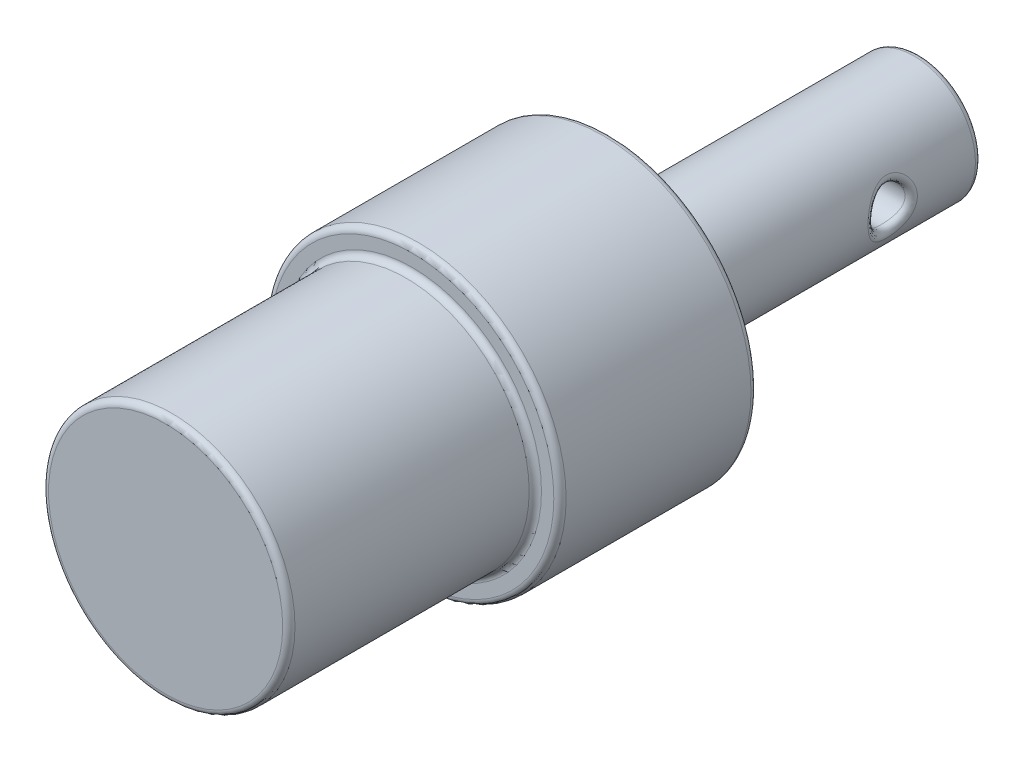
ISO-10303-21;
HEADER;
FILE_DESCRIPTION(('STEP AP214'),'2;1');
FILE_NAME('part.step','',(''),(''),'','','');
FILE_SCHEMA(('AUTOMOTIVE_DESIGN { 1 0 10303 214 1 1 1 1 }'));
ENDSEC;
DATA;
#1=APPLICATION_CONTEXT('core data for automotive mechanical design processes');
#2=APPLICATION_PROTOCOL_DEFINITION('international standard','automotive_design',2000,#1);
#3=PRODUCT_CONTEXT('',#1,'mechanical');
#4=PRODUCT('Part','Part','',(#3));
#5=PRODUCT_RELATED_PRODUCT_CATEGORY('part','',(#4));
#6=PRODUCT_DEFINITION_FORMATION('','',#4);
#7=PRODUCT_DEFINITION_CONTEXT('part definition',#1,'design');
#8=PRODUCT_DEFINITION('design','',#6,#7);
#9=PRODUCT_DEFINITION_SHAPE('','',#8);
#10=(LENGTH_UNIT() NAMED_UNIT(*) SI_UNIT(.MILLI.,.METRE.));
#11=(NAMED_UNIT(*) PLANE_ANGLE_UNIT() SI_UNIT($,.RADIAN.));
#12=(NAMED_UNIT(*) SI_UNIT($,.STERADIAN.) SOLID_ANGLE_UNIT());
#13=UNCERTAINTY_MEASURE_WITH_UNIT(LENGTH_MEASURE(1.E-05),#10,'distance_accuracy_value','');
#14=(GEOMETRIC_REPRESENTATION_CONTEXT(3) GLOBAL_UNCERTAINTY_ASSIGNED_CONTEXT((#13)) GLOBAL_UNIT_ASSIGNED_CONTEXT((#10,
#11,#12)) REPRESENTATION_CONTEXT('',''));
#15=CARTESIAN_POINT('',(0.,0.,0.));
#16=DIRECTION('',(0.,0.,1.));
#17=DIRECTION('',(1.,0.,0.));
#18=AXIS2_PLACEMENT_3D('',#15,#16,#17);
#19=CARTESIAN_POINT('',(0.,0.,-64.));
#20=DIRECTION('',(0.,0.,1.));
#21=DIRECTION('',(1.,0.,0.));
#22=AXIS2_PLACEMENT_3D('',#19,#20,#21);
#23=CONICAL_SURFACE('',#22,0.,1.02974425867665);
#24=CARTESIAN_POINT('',(0.,0.,-61.1413941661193));
#25=DIRECTION('',(0.,0.,-1.));
#26=DIRECTION('',(-1.,0.,0.));
#27=AXIS2_PLACEMENT_3D('',#24,#25,#26);
#28=CIRCLE('',#27,4.75751903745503);
#29=CARTESIAN_POINT('',(-4.75751903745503,0.,-61.1413941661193));
#30=VERTEX_POINT('',#29);
#31=EDGE_CURVE('E152',#30,#30,#28,.T.);
#32=ORIENTED_EDGE('',*,*,#31,.T.);
#33=EDGE_LOOP('',(#32));
#34=FACE_BOUND('',#33,.T.);
#35=CARTESIAN_POINT('',(0.,0.,-64.));
#36=VERTEX_POINT('',#35);
#37=VERTEX_LOOP('',#36);
#38=FACE_BOUND('',#37,.T.);
#39=ADVANCED_FACE('F31',(#34,#38),#23,.T.);
#40=CARTESIAN_POINT('',(0.,0.,0.));
#41=DIRECTION('',(0.,0.,1.));
#42=DIRECTION('',(1.,0.,0.));
#43=AXIS2_PLACEMENT_3D('',#40,#41,#42);
#44=PLANE('',#43);
#45=CARTESIAN_POINT('',(0.,0.,0.));
#46=DIRECTION('',(0.,0.,1.));
#47=DIRECTION('',(1.,0.,0.));
#48=AXIS2_PLACEMENT_3D('',#45,#46,#47);
#49=CIRCLE('',#48,9.49999999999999);
#50=CARTESIAN_POINT('',(9.49999999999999,0.,0.));
#51=VERTEX_POINT('',#50);
#52=EDGE_CURVE('E11',#51,#51,#49,.T.);
#53=ORIENTED_EDGE('',*,*,#52,.T.);
#54=EDGE_LOOP('',(#53));
#55=FACE_BOUND('',#54,.T.);
#56=ADVANCED_FACE('F48',(#55),#44,.T.);
#57=CARTESIAN_POINT('',(0.,0.,-64.));
#58=DIRECTION('',(0.,0.,-1.));
#59=DIRECTION('',(-1.,0.,0.));
#60=AXIS2_PLACEMENT_3D('',#57,#58,#59);
#61=CYLINDRICAL_SURFACE('',#60,9.99999999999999);
#62=CARTESIAN_POINT('',(0.,0.,-19.5));
#63=DIRECTION('',(0.,0.,1.));
#64=DIRECTION('',(1.,0.,0.));
#65=AXIS2_PLACEMENT_3D('',#62,#63,#64);
#66=CIRCLE('',#65,9.99999999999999);
#67=CARTESIAN_POINT('',(9.99999999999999,0.,-19.5));
#68=VERTEX_POINT('',#67);
#69=EDGE_CURVE('E43',#68,#68,#66,.T.);
#70=ORIENTED_EDGE('',*,*,#69,.T.);
#71=EDGE_LOOP('',(#70));
#72=FACE_BOUND('',#71,.T.);
#73=CARTESIAN_POINT('',(0.,0.,-0.5));
#74=DIRECTION('',(0.,0.,1.));
#75=DIRECTION('',(1.,0.,0.));
#76=AXIS2_PLACEMENT_3D('',#73,#74,#75);
#77=CIRCLE('',#76,9.99999999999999);
#78=CARTESIAN_POINT('',(9.99999999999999,0.,-0.5));
#79=VERTEX_POINT('',#78);
#80=EDGE_CURVE('E111',#79,#79,#77,.F.);
#81=ORIENTED_EDGE('',*,*,#80,.T.);
#82=EDGE_LOOP('',(#81));
#83=FACE_BOUND('',#82,.T.);
#84=ADVANCED_FACE('F54',(#72,#83),#61,.T.);
#85=CARTESIAN_POINT('',(0.,9.99999999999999,-20.));
#86=DIRECTION('',(0.,0.,1.));
#87=DIRECTION('',(1.,0.,0.));
#88=AXIS2_PLACEMENT_3D('',#85,#86,#87);
#89=PLANE('',#88);
#90=CARTESIAN_POINT('',(0.,0.,-20.));
#91=DIRECTION('',(0.,0.,1.));
#92=DIRECTION('',(1.,0.,0.));
#93=AXIS2_PLACEMENT_3D('',#90,#91,#92);
#94=CIRCLE('',#93,11.5);
#95=CARTESIAN_POINT('',(11.5,0.,-20.));
#96=VERTEX_POINT('',#95);
#97=EDGE_CURVE('E114',#96,#96,#94,.T.);
#98=ORIENTED_EDGE('',*,*,#97,.T.);
#99=EDGE_LOOP('',(#98));
#100=FACE_BOUND('',#99,.T.);
#101=CARTESIAN_POINT('',(0.,0.,-20.));
#102=DIRECTION('',(0.,0.,1.));
#103=DIRECTION('',(1.,0.,0.));
#104=AXIS2_PLACEMENT_3D('',#101,#102,#103);
#105=CIRCLE('',#104,10.5);
#106=CARTESIAN_POINT('',(10.5,0.,-20.));
#107=VERTEX_POINT('',#106);
#108=EDGE_CURVE('E117',#107,#107,#105,.F.);
#109=ORIENTED_EDGE('',*,*,#108,.T.);
#110=EDGE_LOOP('',(#109));
#111=FACE_BOUND('',#110,.T.);
#112=ADVANCED_FACE('F207',(#100,#111),#89,.T.);
#113=CARTESIAN_POINT('',(0.,0.,-64.));
#114=DIRECTION('',(0.,0.,-1.));
#115=DIRECTION('',(-1.,0.,0.));
#116=AXIS2_PLACEMENT_3D('',#113,#114,#115);
#117=CYLINDRICAL_SURFACE('',#116,12.);
#118=CARTESIAN_POINT('',(0.,0.,-35.5));
#119=DIRECTION('',(0.,0.,-1.));
#120=DIRECTION('',(-1.,0.,0.));
#121=AXIS2_PLACEMENT_3D('',#118,#119,#120);
#122=CIRCLE('',#121,12.);
#123=CARTESIAN_POINT('',(-12.,0.,-35.5));
#124=VERTEX_POINT('',#123);
#125=EDGE_CURVE('E120',#124,#124,#122,.F.);
#126=ORIENTED_EDGE('',*,*,#125,.T.);
#127=EDGE_LOOP('',(#126));
#128=FACE_BOUND('',#127,.T.);
#129=CARTESIAN_POINT('',(0.,0.,-20.5));
#130=DIRECTION('',(0.,0.,1.));
#131=DIRECTION('',(1.,0.,0.));
#132=AXIS2_PLACEMENT_3D('',#129,#130,#131);
#133=CIRCLE('',#132,12.);
#134=CARTESIAN_POINT('',(12.,0.,-20.5));
#135=VERTEX_POINT('',#134);
#136=EDGE_CURVE('E123',#135,#135,#133,.F.);
#137=ORIENTED_EDGE('',*,*,#136,.T.);
#138=EDGE_LOOP('',(#137));
#139=FACE_BOUND('',#138,.T.);
#140=ADVANCED_FACE('F182',(#128,#139),#117,.T.);
#141=CARTESIAN_POINT('',(0.,12.,-36.));
#142=DIRECTION('',(0.,0.,-1.));
#143=DIRECTION('',(-1.,0.,0.));
#144=AXIS2_PLACEMENT_3D('',#141,#142,#143);
#145=PLANE('',#144);
#146=CARTESIAN_POINT('',(0.,0.,-36.));
#147=DIRECTION('',(0.,0.,-1.));
#148=DIRECTION('',(-1.,0.,0.));
#149=AXIS2_PLACEMENT_3D('',#146,#147,#148);
#150=CIRCLE('',#149,5.5);
#151=CARTESIAN_POINT('',(-5.5,0.,-36.));
#152=VERTEX_POINT('',#151);
#153=EDGE_CURVE('E171',#152,#152,#150,.F.);
#154=ORIENTED_EDGE('',*,*,#153,.T.);
#155=EDGE_LOOP('',(#154));
#156=FACE_BOUND('',#155,.T.);
#157=CARTESIAN_POINT('',(0.,0.,-36.));
#158=DIRECTION('',(0.,0.,-1.));
#159=DIRECTION('',(-1.,0.,0.));
#160=AXIS2_PLACEMENT_3D('',#157,#158,#159);
#161=CIRCLE('',#160,11.5);
#162=CARTESIAN_POINT('',(-11.5,0.,-36.));
#163=VERTEX_POINT('',#162);
#164=EDGE_CURVE('E167',#163,#163,#161,.T.);
#165=ORIENTED_EDGE('',*,*,#164,.T.);
#166=EDGE_LOOP('',(#165));
#167=FACE_BOUND('',#166,.T.);
#168=ADVANCED_FACE('F86',(#156,#167),#145,.T.);
#169=CARTESIAN_POINT('',(0.,0.,-64.));
#170=DIRECTION('',(0.,0.,-1.));
#171=DIRECTION('',(-1.,0.,0.));
#172=AXIS2_PLACEMENT_3D('',#169,#170,#171);
#173=CYLINDRICAL_SURFACE('',#172,5.);
#174=CARTESIAN_POINT('',(0.,0.,-60.7128105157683));
#175=DIRECTION('',(0.,0.,1.));
#176=DIRECTION('',(1.,0.,0.));
#177=AXIS2_PLACEMENT_3D('',#174,#175,#176);
#178=CIRCLE('',#177,5.);
#179=CARTESIAN_POINT('',(5.,0.,-60.7128105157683));
#180=VERTEX_POINT('',#179);
#181=EDGE_CURVE('E150',#180,#180,#178,.T.);
#182=ORIENTED_EDGE('',*,*,#181,.T.);
#183=EDGE_LOOP('',(#182));
#184=FACE_BOUND('',#183,.T.);
#185=CARTESIAN_POINT('',(0.,0.,-36.5));
#186=DIRECTION('',(0.,0.,-1.));
#187=DIRECTION('',(-1.,0.,0.));
#188=AXIS2_PLACEMENT_3D('',#185,#186,#187);
#189=CIRCLE('',#188,5.);
#190=CARTESIAN_POINT('',(-5.,0.,-36.5));
#191=VERTEX_POINT('',#190);
#192=EDGE_CURVE('E161',#191,#191,#189,.T.);
#193=ORIENTED_EDGE('',*,*,#192,.T.);
#194=EDGE_LOOP('',(#193));
#195=FACE_BOUND('',#194,.T.);
#196=CARTESIAN_POINT('',(4.4992315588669,0.0623690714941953,-55.4987028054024));
#197=CARTESIAN_POINT('',(4.70641555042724,0.066191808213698,-55.4985437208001));
#198=CARTESIAN_POINT('',(4.85286046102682,0.0749886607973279,-55.64488697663));
#199=CARTESIAN_POINT('',(4.9993053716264,0.0837855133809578,-55.79123023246));
#200=CARTESIAN_POINT('',(4.99914617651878,0.0923986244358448,-55.9982704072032));
#201=CARTESIAN_POINT('',(4.50118130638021,-0.0166627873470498,-55.5019937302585));
#202=CARTESIAN_POINT('',(4.70816919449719,-0.0176539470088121,-55.5022379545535));
#203=CARTESIAN_POINT('',(4.85461864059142,-0.0200259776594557,-55.6488438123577));
#204=CARTESIAN_POINT('',(5.00106763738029,-0.0223572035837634,-55.795448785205));
#205=CARTESIAN_POINT('',(5.00131256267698,-0.0246856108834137,-56.0026583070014));
#206=CARTESIAN_POINT('',(4.49939924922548,-0.0959957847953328,-55.4990085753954));
#207=CARTESIAN_POINT('',(4.70656141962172,-0.101969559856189,-55.4988750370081));
#208=CARTESIAN_POINT('',(4.8530094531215,-0.11544874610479,-55.6452497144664));
#209=CARTESIAN_POINT('',(4.9994517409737,-0.129035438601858,-55.7916116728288));
#210=CARTESIAN_POINT('',(4.99933249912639,-0.142215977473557,-55.9986781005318));
#211=CARTESIAN_POINT('',(4.48856905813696,-0.252916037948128,-55.4806324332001));
#212=CARTESIAN_POINT('',(4.69682831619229,-0.268247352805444,-55.4782705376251));
#213=CARTESIAN_POINT('',(4.84325261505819,-0.303940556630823,-55.6231761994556));
#214=CARTESIAN_POINT('',(4.98967168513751,-0.339738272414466,-55.7680697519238));
#215=CARTESIAN_POINT('',(4.98729895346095,-0.374690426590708,-55.9741765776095));
#216=CARTESIAN_POINT('',(4.47952135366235,-0.330503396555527,-55.4652421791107));
#217=CARTESIAN_POINT('',(4.68868865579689,-0.35033302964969,-55.4609985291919));
#218=CARTESIAN_POINT('',(4.83510535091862,-0.39700973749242,-55.604697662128));
#219=CARTESIAN_POINT('',(4.98149312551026,-0.443919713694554,-55.7483301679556));
#220=CARTESIAN_POINT('',(4.97724594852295,-0.489634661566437,-55.9536562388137));
#221=CARTESIAN_POINT('',(4.45529425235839,-0.480424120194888,-55.4230788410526));
#222=CARTESIAN_POINT('',(4.6670111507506,-0.508009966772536,-55.4140066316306));
#223=CARTESIAN_POINT('',(4.81337920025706,-0.576272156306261,-55.5542825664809));
#224=CARTESIAN_POINT('',(4.9597207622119,-0.644758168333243,-55.6944965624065));
#225=CARTESIAN_POINT('',(4.95032694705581,-0.711739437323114,-55.8974384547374));
#226=CARTESIAN_POINT('',(4.44022591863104,-0.552826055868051,-55.396511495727));
#227=CARTESIAN_POINT('',(4.65354250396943,-0.583785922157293,-55.3844479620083));
#228=CARTESIAN_POINT('',(4.79989873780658,-0.662557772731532,-55.5225893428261));
#229=CARTESIAN_POINT('',(4.94619636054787,-0.741639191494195,-55.6605886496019));
#230=CARTESIAN_POINT('',(4.93358435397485,-0.819001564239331,-55.8620153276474));
#231=CARTESIAN_POINT('',(4.40535589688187,-0.692192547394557,-55.3329442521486));
#232=CARTESIAN_POINT('',(4.622587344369,-0.728396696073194,-55.3143637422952));
#233=CARTESIAN_POINT('',(4.76888810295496,-0.827814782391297,-55.4472131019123));
#234=CARTESIAN_POINT('',(4.91513106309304,-0.927543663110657,-55.579921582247));
#235=CARTESIAN_POINT('',(4.8948398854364,-1.0254704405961,-55.7772590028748));
#236=CARTESIAN_POINT('',(4.38555304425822,-0.759155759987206,-55.2959417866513));
#237=CARTESIAN_POINT('',(4.60506762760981,-0.797283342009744,-55.2737555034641));
#238=CARTESIAN_POINT('',(4.75135693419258,-0.906784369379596,-55.4035271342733));
#239=CARTESIAN_POINT('',(4.89755690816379,-1.01663801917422,-55.5330663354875));
#240=CARTESIAN_POINT('',(4.87283671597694,-1.12467520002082,-55.7279223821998));
#241=CARTESIAN_POINT('',(4.34153538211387,-0.890496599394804,-55.2097860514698));
#242=CARTESIAN_POINT('',(4.56645183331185,-0.930856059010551,-55.1802870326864));
#243=CARTESIAN_POINT('',(4.71270166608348,-1.06057397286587,-55.3026449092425));
#244=CARTESIAN_POINT('',(4.85885163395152,-1.19069218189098,-55.4247413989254));
#245=CARTESIAN_POINT('',(4.82392820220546,-1.31925422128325,-55.6130480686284));
#246=CARTESIAN_POINT('',(4.31711650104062,-0.95441728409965,-55.1599954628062));
#247=CARTESIAN_POINT('',(4.54517212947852,-0.994963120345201,-55.1267188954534));
#248=CARTESIAN_POINT('',(4.69141740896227,-1.13478301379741,-55.2447509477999));
#249=CARTESIAN_POINT('',(4.83753849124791,-1.27499561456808,-55.3624208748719));
#250=CARTESIAN_POINT('',(4.79679611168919,-1.41395153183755,-55.5466606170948));
#251=CARTESIAN_POINT('',(4.26718543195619,-1.07332535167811,-55.0509454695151));
#252=CARTESIAN_POINT('',(4.50214439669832,-1.11234518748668,-55.0112265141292));
#253=CARTESIAN_POINT('',(4.64837960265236,-1.27144145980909,-55.1194227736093));
#254=CARTESIAN_POINT('',(4.7944901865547,-1.43093511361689,-55.2272565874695));
#255=CARTESIAN_POINT('',(4.74131714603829,-1.59011163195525,-55.4012606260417));
#256=CARTESIAN_POINT('',(4.24167289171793,-1.12830982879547,-54.991682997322));
#257=CARTESIAN_POINT('',(4.48038350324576,-1.16558088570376,-54.949224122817));
#258=CARTESIAN_POINT('',(4.62662590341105,-1.33388704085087,-55.0519854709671));
#259=CARTESIAN_POINT('',(4.77274243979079,-1.50252954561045,-55.1543167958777));
#260=CARTESIAN_POINT('',(4.71296987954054,-1.67157011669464,-55.3222439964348));
#261=CARTESIAN_POINT('',(4.19036138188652,-1.23160802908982,-54.8605635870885));
#262=CARTESIAN_POINT('',(4.43717432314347,-1.26372890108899,-54.8145814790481));
#263=CARTESIAN_POINT('',(4.58346716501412,-1.44973800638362,-54.9049327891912));
#264=CARTESIAN_POINT('',(4.72961678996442,-1.63613316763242,-54.9947973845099));
#265=CARTESIAN_POINT('',(4.65595709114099,-1.82460448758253,-55.1474181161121));
#266=CARTESIAN_POINT('',(4.16466082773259,-1.27921423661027,-54.788124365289));
#267=CARTESIAN_POINT('',(4.41587204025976,-1.30772006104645,-54.7414970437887));
#268=CARTESIAN_POINT('',(4.56218634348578,-1.5022403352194,-54.8248012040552));
#269=CARTESIAN_POINT('',(4.70838908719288,-1.69702354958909,-54.9076112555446));
#270=CARTESIAN_POINT('',(4.6274009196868,-1.89513220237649,-55.0508324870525));
#271=CARTESIAN_POINT('',(4.11801794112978,-1.3615135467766,-54.6354474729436));
#272=CARTESIAN_POINT('',(4.37776033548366,-1.38214941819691,-54.5908794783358));
#273=CARTESIAN_POINT('',(4.52417230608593,-1.59167420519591,-54.6589010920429));
#274=CARTESIAN_POINT('',(4.67046929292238,-1.80146902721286,-54.7264281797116));
#275=CARTESIAN_POINT('',(4.57557549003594,-2.01705710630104,-54.847263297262));
#276=CARTESIAN_POINT('',(4.09707406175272,-1.39621084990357,-54.555212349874));
#277=CARTESIAN_POINT('',(4.36099461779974,-1.41247519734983,-54.5133933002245));
#278=CARTESIAN_POINT('',(4.50743761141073,-1.6286108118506,-54.573134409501));
#279=CARTESIAN_POINT('',(4.65382105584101,-1.84487590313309,-54.6324794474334));
#280=CARTESIAN_POINT('',(4.55230451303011,-2.06846051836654,-54.7402831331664));
#281=CARTESIAN_POINT('',(4.06346717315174,-1.45038917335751,-54.3918236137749));
#282=CARTESIAN_POINT('',(4.33438181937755,-1.45902075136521,-54.3587762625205));
#283=CARTESIAN_POINT('',(4.48093488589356,-1.68557558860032,-54.4013689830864));
#284=CARTESIAN_POINT('',(4.6274284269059,-1.91225693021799,-54.4435857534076));
#285=CARTESIAN_POINT('',(4.51496352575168,-2.14872470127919,-54.5224314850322));
#286=CARTESIAN_POINT('',(4.05055186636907,-1.4703379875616,-54.3088558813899));
#287=CARTESIAN_POINT('',(4.32437236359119,-1.47558163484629,-54.2818367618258));
#288=CARTESIAN_POINT('',(4.47095361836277,-1.70612536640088,-54.3154728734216));
#289=CARTESIAN_POINT('',(4.61752179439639,-1.93669675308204,-54.3489153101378));
#290=CARTESIAN_POINT('',(4.50061318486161,-2.17827850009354,-54.4118078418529));
#291=CARTESIAN_POINT('',(4.03391358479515,-1.49585448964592,-54.1402568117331));
#292=CARTESIAN_POINT('',(4.31149945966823,-1.49668060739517,-54.1271701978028));
#293=CARTESIAN_POINT('',(4.45815115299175,-1.73230062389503,-54.1425784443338));
#294=CARTESIAN_POINT('',(4.60478657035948,-1.96795300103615,-54.1577839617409));
#295=CARTESIAN_POINT('',(4.48212620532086,-2.21608072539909,-54.1870090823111));
#296=CARTESIAN_POINT('',(4.03018278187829,-1.50143442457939,-54.0546278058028));
#297=CARTESIAN_POINT('',(4.3086623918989,-1.50117501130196,-54.0496352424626));
#298=CARTESIAN_POINT('',(4.45532385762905,-1.73793881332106,-54.0555811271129));
#299=CARTESIAN_POINT('',(4.60198408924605,-1.97470498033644,-54.0615592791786));
#300=CARTESIAN_POINT('',(4.4779808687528,-2.22434729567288,-54.0728370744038));
#301=CARTESIAN_POINT('',(4.03238235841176,-1.49810122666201,-53.8919771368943));
#302=CARTESIAN_POINT('',(4.31035391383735,-1.49844689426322,-53.9019053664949));
#303=CARTESIAN_POINT('',(4.45700483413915,-1.73454285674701,-53.8901091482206));
#304=CARTESIAN_POINT('',(4.60365638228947,-1.97063766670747,-53.8783317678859));
#305=CARTESIAN_POINT('',(4.4804248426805,-2.21940922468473,-53.8559695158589));
#306=CARTESIAN_POINT('',(4.03742117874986,-1.49052570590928,-53.8149169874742));
#307=CARTESIAN_POINT('',(4.31419932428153,-1.49231135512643,-53.8318858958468));
#308=CARTESIAN_POINT('',(4.46083611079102,-1.72686296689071,-53.8116166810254));
#309=CARTESIAN_POINT('',(4.60745617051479,-1.96144832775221,-53.7915357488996));
#310=CARTESIAN_POINT('',(4.48602353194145,-2.20818623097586,-53.7532226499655));
#311=CARTESIAN_POINT('',(4.05479514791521,-1.46375417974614,-53.6633260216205));
#312=CARTESIAN_POINT('',(4.32767216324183,-1.47008824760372,-53.6923487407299));
#313=CARTESIAN_POINT('',(4.47423782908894,-1.6993307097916,-53.6557406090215));
#314=CARTESIAN_POINT('',(4.6207882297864,-1.92860514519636,-53.6193162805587));
#315=CARTESIAN_POINT('',(4.50532794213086,-2.16852471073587,-53.5511013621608));
#316=CARTESIAN_POINT('',(4.0671315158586,-1.44455623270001,-53.5887956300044));
#317=CARTESIAN_POINT('',(4.3372735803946,-1.45404450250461,-53.622966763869));
#318=CARTESIAN_POINT('',(4.48380922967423,-1.67947630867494,-53.5783571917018));
#319=CARTESIAN_POINT('',(4.63029473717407,-1.90501552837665,-53.5340586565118));
#320=CARTESIAN_POINT('',(4.51903501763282,-2.14008330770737,-53.4517275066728));
#321=CARTESIAN_POINT('',(4.0975839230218,-1.39530287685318,-53.4441468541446));
#322=CARTESIAN_POINT('',(4.36142098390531,-1.41163560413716,-53.4858272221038));
#323=CARTESIAN_POINT('',(4.50785710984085,-1.62761775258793,-53.4260736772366));
#324=CARTESIAN_POINT('',(4.65424561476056,-1.84370330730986,-53.3666281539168));
#325=CARTESIAN_POINT('',(4.55287102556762,-2.06711537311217,-53.2588624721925));
#326=CARTESIAN_POINT('',(4.1157005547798,-1.36524635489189,-53.3740289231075));
#327=CARTESIAN_POINT('',(4.37593038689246,-1.38534116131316,-53.4181602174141));
#328=CARTESIAN_POINT('',(4.52233409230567,-1.59561235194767,-53.3511738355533));
#329=CARTESIAN_POINT('',(4.66865356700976,-1.80607981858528,-53.284561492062));
#330=CARTESIAN_POINT('',(4.57300061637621,-2.02258719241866,-53.1653718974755));
#331=CARTESIAN_POINT('',(4.15574917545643,-1.29520560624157,-53.2396106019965));
#332=CARTESIAN_POINT('',(4.40856865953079,-1.32226790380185,-53.2860032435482));
#333=CARTESIAN_POINT('',(4.55488519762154,-1.51970701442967,-53.2055056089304));
#334=CARTESIAN_POINT('',(4.70111873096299,-1.71733982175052,-53.1253823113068));
#335=CARTESIAN_POINT('',(4.61749908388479,-1.9188231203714,-52.9861474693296));
#336=CARTESIAN_POINT('',(4.17768263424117,-1.25521755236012,-53.1753124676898));
#337=CARTESIAN_POINT('',(4.42666768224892,-1.28556326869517,-53.2215498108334));
#338=CARTESIAN_POINT('',(4.57296070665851,-1.47580249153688,-53.1347388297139));
#339=CARTESIAN_POINT('',(4.71914602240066,-1.66632173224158,-53.0483084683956));
#340=CARTESIAN_POINT('',(4.6418695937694,-1.85958155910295,-52.9004166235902));
#341=CARTESIAN_POINT('',(4.2254449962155,-1.16200358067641,-53.0478664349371));
#342=CARTESIAN_POINT('',(4.46663804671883,-1.1978808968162,-53.0917515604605));
#343=CARTESIAN_POINT('',(4.61288983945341,-1.37189957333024,-52.9926821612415));
#344=CARTESIAN_POINT('',(4.75901509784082,-1.54624779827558,-52.8940657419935));
#345=CARTESIAN_POINT('',(4.6949388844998,-1.7214867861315,-52.7304885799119));
#346=CARTESIAN_POINT('',(4.25144597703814,-1.10788013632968,-52.9854100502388));
#347=CARTESIAN_POINT('',(4.48869737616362,-1.14593487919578,-53.0268490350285));
#348=CARTESIAN_POINT('',(4.63493930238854,-1.31076736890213,-52.9219831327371));
#349=CARTESIAN_POINT('',(4.78104918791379,-1.47600574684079,-52.8175118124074));
#350=CARTESIAN_POINT('',(4.72382886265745,-1.6413039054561,-52.6472134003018));
#351=CARTESIAN_POINT('',(4.30281979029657,-0.990047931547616,-52.8701324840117));
#352=CARTESIAN_POINT('',(4.53278132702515,-1.03042651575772,-52.9054502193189));
#353=CARTESIAN_POINT('',(4.6790244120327,-1.175944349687,-52.7900832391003));
#354=CARTESIAN_POINT('',(4.82513491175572,-1.32186559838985,-52.6751134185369));
#355=CARTESIAN_POINT('',(4.78091087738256,-1.46673767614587,-52.4935099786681));
#356=CARTESIAN_POINT('',(4.32819255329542,-0.926338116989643,-52.8173123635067));
#357=CARTESIAN_POINT('',(4.55481453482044,-0.966910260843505,-52.8488815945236));
#358=CARTESIAN_POINT('',(4.70106005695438,-1.10225215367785,-52.7288834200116));
#359=CARTESIAN_POINT('',(4.84719482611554,-1.23801819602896,-52.609179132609));
#360=CARTESIAN_POINT('',(4.80910283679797,-1.37235276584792,-52.4230831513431));
#361=CARTESIAN_POINT('',(4.37692779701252,-0.787358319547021,-52.720318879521));
#362=CARTESIAN_POINT('',(4.59743988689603,-0.826258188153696,-52.7440772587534));
#363=CARTESIAN_POINT('',(4.74373432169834,-0.939988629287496,-52.6156408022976));
#364=CARTESIAN_POINT('',(4.8899067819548,-1.05417970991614,-52.4875280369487));
#365=CARTESIAN_POINT('',(4.8632531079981,-1.16645676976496,-52.2937585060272));
#366=CARTESIAN_POINT('',(4.40013513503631,-0.711680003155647,-52.6766828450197));
#367=CARTESIAN_POINT('',(4.61795260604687,-0.748589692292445,-52.696244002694));
#368=CARTESIAN_POINT('',(4.76425496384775,-0.850872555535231,-52.5641791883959));
#369=CARTESIAN_POINT('',(4.91048079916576,-0.953564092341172,-52.4323019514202));
#370=CARTESIAN_POINT('',(4.88903903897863,-1.05434074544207,-52.235577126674));
#371=CARTESIAN_POINT('',(4.44046314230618,-0.553092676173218,-52.6029587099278));
#372=CARTESIAN_POINT('',(4.65373447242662,-0.584168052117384,-52.6150161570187));
#373=CARTESIAN_POINT('',(4.80010096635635,-0.662918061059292,-52.4768030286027));
#374=CARTESIAN_POINT('',(4.94638815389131,-0.742076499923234,-52.338782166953));
#375=CARTESIAN_POINT('',(4.9338479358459,-0.819396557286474,-52.1372782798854));
#376=CARTESIAN_POINT('',(4.45758379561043,-0.470183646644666,-52.5728706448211));
#377=CARTESIAN_POINT('',(4.66905164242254,-0.497337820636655,-52.5815015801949));
#378=CARTESIAN_POINT('',(4.81542631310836,-0.56407961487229,-52.4408885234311));
#379=CARTESIAN_POINT('',(4.96176959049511,-0.631099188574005,-52.3003489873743));
#380=CARTESIAN_POINT('',(4.9528708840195,-0.696568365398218,-52.0971608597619));
#381=CARTESIAN_POINT('',(4.48292399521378,-0.304665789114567,-52.5289171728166));
#382=CARTESIAN_POINT('',(4.69174043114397,-0.323073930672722,-52.5324702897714));
#383=CARTESIAN_POINT('',(4.83816428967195,-0.366051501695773,-52.3883010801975));
#384=CARTESIAN_POINT('',(4.98455899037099,-0.409278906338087,-52.244198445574));
#385=CARTESIAN_POINT('',(4.9810266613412,-0.451356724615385,-52.0385562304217));
#386=CARTESIAN_POINT('',(4.4916032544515,-0.222319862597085,-52.5142101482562));
#387=CARTESIAN_POINT('',(4.69955545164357,-0.235860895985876,-52.5159466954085));
#388=CARTESIAN_POINT('',(4.84598522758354,-0.267216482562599,-52.3706306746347));
#389=CARTESIAN_POINT('',(4.99241189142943,-0.29866366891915,-52.2253218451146));
#390=CARTESIAN_POINT('',(4.99067028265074,-0.329362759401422,-52.0189468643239));
#391=CARTESIAN_POINT('',(4.50073068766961,-0.0562227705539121,-52.4987488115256));
#392=CARTESIAN_POINT('',(4.70776007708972,-0.0597565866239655,-52.4986049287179));
#393=CARTESIAN_POINT('',(4.85421054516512,-0.0676296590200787,-52.3520529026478));
#394=CARTESIAN_POINT('',(5.00065633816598,-0.0756001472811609,-52.2055112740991));
#395=CARTESIAN_POINT('',(5.00081187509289,-0.083292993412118,-51.9983317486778));
#396=CARTESIAN_POINT('',(4.50120197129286,0.0275237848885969,-52.4979553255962));
#397=CARTESIAN_POINT('',(4.70818446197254,0.0292765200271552,-52.4977132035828));
#398=CARTESIAN_POINT('',(4.85463574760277,0.0331159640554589,-52.3510984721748));
#399=CARTESIAN_POINT('',(5.00108283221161,0.0370288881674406,-52.2044932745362));
#400=CARTESIAN_POINT('',(5.00133552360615,0.0407759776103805,-51.9972737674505));
#401=CARTESIAN_POINT('',(4.49620620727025,0.142208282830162,-52.5064144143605));
#402=CARTESIAN_POINT('',(4.70369526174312,0.150893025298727,-52.5071980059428));
#403=CARTESIAN_POINT('',(4.85013337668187,0.170957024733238,-52.3612633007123));
#404=CARTESIAN_POINT('',(4.9965718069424,0.191032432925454,-52.215327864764));
#405=CARTESIAN_POINT('',(4.99578467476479,0.210678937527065,-52.0085525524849));
#406=CARTESIAN_POINT('',(4.49423003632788,0.173787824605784,-52.509759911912));
#407=CARTESIAN_POINT('',(4.70191802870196,0.184374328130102,-52.5109522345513));
#408=CARTESIAN_POINT('',(4.84835230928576,0.208899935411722,-52.3652835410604));
#409=CARTESIAN_POINT('',(4.99478592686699,0.233446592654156,-52.2196162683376));
#410=CARTESIAN_POINT('',(4.99358892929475,0.257463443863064,-52.013013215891));
#411=CARTESIAN_POINT('',(4.4850571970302,0.286554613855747,-52.5253474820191));
#412=CARTESIAN_POINT('',(4.6936718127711,0.303839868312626,-52.5284336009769));
#413=CARTESIAN_POINT('',(4.84009080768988,0.344302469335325,-52.3840022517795));
#414=CARTESIAN_POINT('',(4.98650014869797,0.384896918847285,-52.2395929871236));
#415=CARTESIAN_POINT('',(4.98339688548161,0.424525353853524,-52.0337966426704));
#416=CARTESIAN_POINT('',(4.47455322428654,0.36690988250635,-52.5432817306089));
#417=CARTESIAN_POINT('',(4.68422798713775,0.388759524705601,-52.5485435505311));
#418=CARTESIAN_POINT('',(4.83063867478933,0.44062421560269,-52.4055208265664));
#419=CARTESIAN_POINT('',(4.97701182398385,0.492761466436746,-52.262585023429));
#420=CARTESIAN_POINT('',(4.97172580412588,0.543570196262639,-52.0577089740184));
#421=CARTESIAN_POINT('',(4.44685826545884,0.523165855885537,-52.5917984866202));
#422=CARTESIAN_POINT('',(4.65947547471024,0.552790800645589,-52.6025332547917));
#423=CARTESIAN_POINT('',(4.80583217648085,0.627242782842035,-52.4634640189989));
#424=CARTESIAN_POINT('',(4.95215388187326,0.701967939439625,-52.3244772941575));
#425=CARTESIAN_POINT('',(4.94095362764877,0.775060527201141,-52.1223979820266));
#426=CARTESIAN_POINT('',(4.42964835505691,0.59905324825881,-52.6224168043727));
#427=CARTESIAN_POINT('',(4.64411498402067,0.631986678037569,-52.6365316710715));
#428=CARTESIAN_POINT('',(4.79046110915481,0.717521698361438,-52.4999308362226));
#429=CARTESIAN_POINT('',(4.93673228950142,0.803422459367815,-52.3635142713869));
#430=CARTESIAN_POINT('',(4.9218315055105,0.887486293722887,-52.1632224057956));
#431=CARTESIAN_POINT('',(4.39040308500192,0.743989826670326,-52.6950031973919));
#432=CARTESIAN_POINT('',(4.6093620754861,0.781748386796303,-52.7162906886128));
#433=CARTESIAN_POINT('',(4.75564989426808,0.888938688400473,-52.5857793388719));
#434=CARTESIAN_POINT('',(4.90186459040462,0.996492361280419,-52.455448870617));
#435=CARTESIAN_POINT('',(4.87822565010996,1.1022071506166,-52.2600042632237));
#436=CARTESIAN_POINT('',(4.36838854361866,0.813066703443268,-52.7369224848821));
#437=CARTESIAN_POINT('',(4.58994910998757,0.852402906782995,-52.7620984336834));
#438=CARTESIAN_POINT('',(4.73622731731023,0.970113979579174,-52.6351054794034));
#439=CARTESIAN_POINT('',(4.88239786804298,1.08822207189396,-52.5084008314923));
#440=CARTESIAN_POINT('',(4.85376504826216,1.20454326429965,-52.3158966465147));
#441=CARTESIAN_POINT('',(4.32161444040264,0.943254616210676,-52.8309312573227));
#442=CARTESIAN_POINT('',(4.54910006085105,0.983816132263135,-52.8634687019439));
#443=CARTESIAN_POINT('',(4.69533991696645,1.12185402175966,-52.7446768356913));
#444=CARTESIAN_POINT('',(4.84147267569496,1.26029189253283,-52.6261721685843));
#445=CARTESIAN_POINT('',(4.80179382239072,1.397414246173,-52.4412416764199));
#446=CARTESIAN_POINT('',(4.29685562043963,1.00436779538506,-52.8830179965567));
#447=CARTESIAN_POINT('',(4.52763762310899,1.044577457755,-52.9191203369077));
#448=CARTESIAN_POINT('',(4.67387564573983,1.19242162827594,-52.8049191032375));
#449=CARTESIAN_POINT('',(4.81998797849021,1.34064328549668,-52.6910977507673));
#450=CARTESIAN_POINT('',(4.77428402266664,1.48795228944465,-52.5106906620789));
#451=CARTESIAN_POINT('',(4.24547185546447,1.12074928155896,-52.9994602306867));
#452=CARTESIAN_POINT('',(4.48360467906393,1.15839601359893,-53.0415179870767));
#453=CARTESIAN_POINT('',(4.62985228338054,1.32537240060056,-52.9379398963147));
#454=CARTESIAN_POINT('',(4.7759601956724,1.49277288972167,-52.8347837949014));
#455=CARTESIAN_POINT('',(4.71719095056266,1.66036930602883,-52.6659469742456));
#456=CARTESIAN_POINT('',(4.21882153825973,1.17547852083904,-53.0643494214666));
#457=CARTESIAN_POINT('',(4.46104223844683,1.21073473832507,-53.108770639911));
#458=CARTESIAN_POINT('',(4.60730130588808,1.38705046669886,-53.0112404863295));
#459=CARTESIAN_POINT('',(4.75342844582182,1.56370456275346,-52.91419254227));
#460=CARTESIAN_POINT('',(4.68757948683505,1.74144966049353,-52.7524658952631));
#461=CARTESIAN_POINT('',(4.1679645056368,1.27345464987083,-53.2028129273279));
#462=CARTESIAN_POINT('',(4.41858442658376,1.30252103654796,-53.2493296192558));
#463=CARTESIAN_POINT('',(4.56490408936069,1.49595764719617,-53.1651480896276));
#464=CARTESIAN_POINT('',(4.71108993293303,1.6897385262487,-53.0814490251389));
#465=CARTESIAN_POINT('',(4.63107167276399,1.88659948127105,-52.9370839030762));
#466=CARTESIAN_POINT('',(4.14375849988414,1.31669821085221,-53.2763897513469));
#467=CARTESIAN_POINT('',(4.39871383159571,1.34186801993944,-53.3226521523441));
#468=CARTESIAN_POINT('',(4.54505863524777,1.54318257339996,-53.2457572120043));
#469=CARTESIAN_POINT('',(4.69130830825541,1.74471504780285,-53.169324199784));
#470=CARTESIAN_POINT('',(4.60417611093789,1.95066401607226,-53.0351863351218));
#471=CARTESIAN_POINT('',(4.10054545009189,1.39073458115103,-53.4313995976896));
#472=CARTESIAN_POINT('',(4.36371914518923,1.40784991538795,-53.4737687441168));
#473=CARTESIAN_POINT('',(4.51017083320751,1.6228807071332,-53.4126081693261));
#474=CARTESIAN_POINT('',(4.6565223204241,1.83813978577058,-53.351919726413));
#475=CARTESIAN_POINT('',(4.55616161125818,2.06034752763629,-53.2418661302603));
#476=CARTESIAN_POINT('',(4.08159585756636,1.42139143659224,-53.5129072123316));
#477=CARTESIAN_POINT('',(4.34869778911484,1.43422966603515,-53.5515269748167));
#478=CARTESIAN_POINT('',(4.49518128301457,1.65519328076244,-53.4989003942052));
#479=CARTESIAN_POINT('',(4.64162104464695,1.87625073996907,-53.4466203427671));
#480=CARTESIAN_POINT('',(4.53510650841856,2.10576509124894,-53.3505429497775));
#481=CARTESIAN_POINT('',(4.05202814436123,1.46821758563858,-53.680767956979));
#482=CARTESIAN_POINT('',(4.32546095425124,1.47395701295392,-53.7087542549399));
#483=CARTESIAN_POINT('',(4.47205231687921,1.70402863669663,-53.6739188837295));
#484=CARTESIAN_POINT('',(4.61859500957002,1.93420151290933,-53.6394361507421));
#485=CARTESIAN_POINT('',(4.50225349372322,2.17513716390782,-53.57435727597));
#486=CARTESIAN_POINT('',(4.0414015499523,1.4844016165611,-53.7671160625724));
#487=CARTESIAN_POINT('',(4.31729048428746,1.48722349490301,-53.788061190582));
#488=CARTESIAN_POINT('',(4.46390593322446,1.72056748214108,-53.7626425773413));
#489=CARTESIAN_POINT('',(4.61051494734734,1.95392521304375,-53.7373564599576));
#490=CARTESIAN_POINT('',(4.49044616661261,2.19911350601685,-53.6894880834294));
#491=CARTESIAN_POINT('',(4.03071387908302,1.50065069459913,-53.9336749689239));
#492=CARTESIAN_POINT('',(4.30906100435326,1.50055513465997,-53.9399619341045));
#493=CARTESIAN_POINT('',(4.45572206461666,1.73715477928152,-53.9326561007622));
#494=CARTESIAN_POINT('',(4.60237743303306,1.97376532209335,-53.925469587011));
#495=CARTESIAN_POINT('',(4.47857097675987,2.22318621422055,-53.9115666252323));
#496=CARTESIAN_POINT('',(4.02977551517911,1.5020543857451,-54.0137249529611));
#497=CARTESIAN_POINT('',(4.30834732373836,1.50168608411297,-54.0123425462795));
#498=CARTESIAN_POINT('',(4.45501119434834,1.73857287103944,-54.0138838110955));
#499=CARTESIAN_POINT('',(4.60167247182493,1.97546449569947,-54.0153479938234));
#500=CARTESIAN_POINT('',(4.47752835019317,2.22526575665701,-54.0182999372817));
#501=CARTESIAN_POINT('',(4.03631837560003,1.49213962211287,-54.172828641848));
#502=CARTESIAN_POINT('',(4.31337659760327,1.49357503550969,-54.1570772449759));
#503=CARTESIAN_POINT('',(4.46001156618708,1.72847129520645,-54.1759519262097));
#504=CARTESIAN_POINT('',(4.60664458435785,1.963371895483,-54.1947564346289));
#505=CARTESIAN_POINT('',(4.48479819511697,2.21057721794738,-54.2304381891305));
#506=CARTESIAN_POINT('',(4.04379884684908,1.48082230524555,-54.2518824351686));
#507=CARTESIAN_POINT('',(4.31910723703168,1.48435285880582,-54.2292621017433));
#508=CARTESIAN_POINT('',(4.46572223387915,1.71695278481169,-54.256792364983));
#509=CARTESIAN_POINT('',(4.61230948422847,1.94960969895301,-54.2840770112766));
#510=CARTESIAN_POINT('',(4.49310982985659,2.1938108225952,-54.3358432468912));
#511=CARTESIAN_POINT('',(4.0656054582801,1.44682697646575,-54.4030087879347));
#512=CARTESIAN_POINT('',(4.33611758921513,1.45585965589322,-54.3694464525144));
#513=CARTESIAN_POINT('',(4.48264631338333,1.68177627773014,-54.4131389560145));
#514=CARTESIAN_POINT('',(4.62915234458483,1.90774071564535,-54.4566116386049));
#515=CARTESIAN_POINT('',(4.51733939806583,2.14344737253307,-54.53734505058));
#516=CARTESIAN_POINT('',(4.07959748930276,1.42470106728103,-54.4752350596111));
#517=CARTESIAN_POINT('',(4.34709513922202,1.4371309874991,-54.4373540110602));
#518=CARTESIAN_POINT('',(4.4935918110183,1.65870699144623,-54.4887184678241));
#519=CARTESIAN_POINT('',(4.64003022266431,1.88041063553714,-54.5397584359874));
#520=CARTESIAN_POINT('',(4.5328860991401,2.11066824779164,-54.6336467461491));
#521=CARTESIAN_POINT('',(4.11265968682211,1.37018601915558,-54.6149971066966));
#522=CARTESIAN_POINT('',(4.37351156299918,1.38960402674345,-54.5712075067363));
#523=CARTESIAN_POINT('',(4.51991034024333,1.60084645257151,-54.6370485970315));
#524=CARTESIAN_POINT('',(4.6662524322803,1.8122139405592,-54.7025663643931));
#525=CARTESIAN_POINT('',(4.56962187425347,2.02990521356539,-54.819996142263));
#526=CARTESIAN_POINT('',(4.13173136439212,1.33779382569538,-54.6825314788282));
#527=CARTESIAN_POINT('',(4.3889166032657,1.36087488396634,-54.6370815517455));
#528=CARTESIAN_POINT('',(4.53528468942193,1.56605171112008,-54.709798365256));
#529=CARTESIAN_POINT('',(4.68156302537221,1.7714428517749,-54.7821445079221));
#530=CARTESIAN_POINT('',(4.59081262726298,1.98191677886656,-54.9100419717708));
#531=CARTESIAN_POINT('',(4.17457467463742,1.26085550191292,-54.8164858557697));
#532=CARTESIAN_POINT('',(4.42408964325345,1.29074653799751,-54.7700730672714));
#533=CARTESIAN_POINT('',(4.57038375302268,1.4820099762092,-54.8561140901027));
#534=CARTESIAN_POINT('',(4.7165768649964,1.67351587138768,-54.9417303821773));
#535=CARTESIAN_POINT('',(4.63841630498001,1.86793407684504,-55.088647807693));
#536=CARTESIAN_POINT('',(4.19859156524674,1.21557987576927,-54.8824421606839));
#537=CARTESIAN_POINT('',(4.44407409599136,1.24863150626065,-54.8369171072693));
#538=CARTESIAN_POINT('',(4.59034830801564,1.43187458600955,-54.929331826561));
#539=CARTESIAN_POINT('',(4.73649912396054,1.61545400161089,-55.0213339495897));
#540=CARTESIAN_POINT('',(4.66510173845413,1.80085907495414,-55.1765895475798));
#541=CARTESIAN_POINT('',(4.24779136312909,1.11529360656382,-55.0062157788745));
#542=CARTESIAN_POINT('',(4.48558774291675,1.1530214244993,-54.9643608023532));
#543=CARTESIAN_POINT('',(4.63182646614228,1.31914271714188,-55.0684647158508));
#544=CARTESIAN_POINT('',(4.7779419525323,1.48559799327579,-55.1721539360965));
#545=CARTESIAN_POINT('',(4.71976818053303,1.65228682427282,-55.3416210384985));
#546=CARTESIAN_POINT('',(4.2729746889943,1.06027944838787,-55.0640301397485));
#547=CARTESIAN_POINT('',(4.50710758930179,1.09959134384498,-55.0249927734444));
#548=CARTESIAN_POINT('',(4.65334062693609,1.25654173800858,-55.1343772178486));
#549=CARTESIAN_POINT('',(4.79945287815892,1.41388252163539,-55.2434141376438));
#550=CARTESIAN_POINT('',(4.74774965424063,1.57078436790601,-55.4187068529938));
#551=CARTESIAN_POINT('',(4.32408980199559,0.936823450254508,-55.1746347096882));
#552=CARTESIAN_POINT('',(4.55121051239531,0.977449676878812,-55.1423351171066));
#553=CARTESIAN_POINT('',(4.6974669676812,1.11443766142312,-55.2616873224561));
#554=CARTESIAN_POINT('',(4.84358359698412,1.25187442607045,-55.3806350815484));
#555=CARTESIAN_POINT('',(4.80454422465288,1.38788659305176,-55.5661796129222));
#556=CARTESIAN_POINT('',(4.34991926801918,0.867658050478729,-55.2266485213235));
#557=CARTESIAN_POINT('',(4.57376781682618,0.907863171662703,-55.1984591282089));
#558=CARTESIAN_POINT('',(4.72002856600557,1.03398090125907,-55.3222971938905));
#559=CARTESIAN_POINT('',(4.86618105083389,1.16055110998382,-55.4458553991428));
#560=CARTESIAN_POINT('',(4.83324363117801,1.28541933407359,-55.6355313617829));
#561=CARTESIAN_POINT('',(4.39732387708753,0.720808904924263,-55.3183019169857));
#562=CARTESIAN_POINT('',(4.61543321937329,0.7580245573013,-55.2981518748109));
#563=CARTESIAN_POINT('',(4.76174767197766,0.861660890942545,-55.4298479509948));
#564=CARTESIAN_POINT('',(4.90795181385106,0.965747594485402,-55.5612604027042));
#565=CARTESIAN_POINT('',(4.88591541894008,1.06786504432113,-55.7577358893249));
#566=CARTESIAN_POINT('',(4.4188997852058,0.643126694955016,-55.3579437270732));
#567=CARTESIAN_POINT('',(4.63458277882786,0.677747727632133,-55.3418430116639));
#568=CARTESIAN_POINT('',(4.78090579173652,0.769799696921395,-55.4767912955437));
#569=CARTESIAN_POINT('',(4.92716650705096,0.862226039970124,-55.6115894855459));
#570=CARTESIAN_POINT('',(4.90988865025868,0.952780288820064,-55.8105916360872));
#571=CARTESIAN_POINT('',(4.45488743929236,0.48334951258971,-55.4225340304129));
#572=CARTESIAN_POINT('',(4.6666159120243,0.511201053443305,-55.4133171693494));
#573=CARTESIAN_POINT('',(4.81299970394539,0.579810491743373,-55.5535952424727));
#574=CARTESIAN_POINT('',(4.95932237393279,0.648776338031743,-55.6937280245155));
#575=CARTESIAN_POINT('',(4.94987493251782,0.716073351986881,-55.8967120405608));
#576=CARTESIAN_POINT('',(4.46946872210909,0.401418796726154,-55.447833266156));
#577=CARTESIAN_POINT('',(4.67969035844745,0.425055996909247,-55.4415818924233));
#578=CARTESIAN_POINT('',(4.82608246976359,0.481903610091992,-55.5838630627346));
#579=CARTESIAN_POINT('',(4.97245467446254,0.53897121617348,-55.7260979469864));
#580=CARTESIAN_POINT('',(4.96607635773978,0.594694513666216,-55.9304443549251));
#581=CARTESIAN_POINT('',(4.49057805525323,0.233898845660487,-55.4841236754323));
#582=CARTESIAN_POINT('',(4.69861795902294,0.248228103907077,-55.4821457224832));
#583=CARTESIAN_POINT('',(4.84505455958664,0.281152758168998,-55.6273519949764));
#584=CARTESIAN_POINT('',(4.99146918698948,0.314300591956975,-55.7725085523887));
#585=CARTESIAN_POINT('',(4.98953117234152,0.346516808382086,-55.9788315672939));
#586=CARTESIAN_POINT('',(4.49711131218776,0.148312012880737,-55.4951240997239));
#587=CARTESIAN_POINT('',(4.70450775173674,0.157408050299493,-55.494524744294));
#588=CARTESIAN_POINT('',(4.850948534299,0.17831202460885,-55.6405841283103));
#589=CARTESIAN_POINT('',(4.9973881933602,0.199258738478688,-55.7866408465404));
#590=CARTESIAN_POINT('',(4.99679034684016,0.219721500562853,-55.9934987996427));
#591=CARTESIAN_POINT('',(4.4992315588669,0.0623690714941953,-55.4987028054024));
#592=CARTESIAN_POINT('',(4.70641555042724,0.066191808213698,-55.4985437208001));
#593=CARTESIAN_POINT('',(4.85286046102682,0.0749886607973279,-55.64488697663));
#594=CARTESIAN_POINT('',(4.9993053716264,0.0837855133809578,-55.79123023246));
#595=CARTESIAN_POINT('',(4.99914617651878,0.0923986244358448,-55.9982704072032));
#596=(BOUNDED_SURFACE() B_SPLINE_SURFACE(3,2,((#196,#197,#198,#199,#200),(#201,#202,#203,#204,
#205),(#206,#207,#208,#209,#210),(#211,#212,#213,#214,#215),(#216,#217,#218,#219,#220),(#221,
#222,#223,#224,#225),(#226,#227,#228,#229,#230),(#231,#232,#233,#234,#235),(#236,#237,#238,#239,
#240),(#241,#242,#243,#244,#245),(#246,#247,#248,#249,#250),(#251,#252,#253,#254,#255),(#256,
#257,#258,#259,#260),(#261,#262,#263,#264,#265),(#266,#267,#268,#269,#270),(#271,#272,#273,#274,
#275),(#276,#277,#278,#279,#280),(#281,#282,#283,#284,#285),(#286,#287,#288,#289,#290),(#291,
#292,#293,#294,#295),(#296,#297,#298,#299,#300),(#301,#302,#303,#304,#305),(#306,#307,#308,#309,
#310),(#311,#312,#313,#314,#315),(#316,#317,#318,#319,#320),(#321,#322,#323,#324,#325),(#326,
#327,#328,#329,#330),(#331,#332,#333,#334,#335),(#336,#337,#338,#339,#340),(#341,#342,#343,#344,
#345),(#346,#347,#348,#349,#350),(#351,#352,#353,#354,#355),(#356,#357,#358,#359,#360),(#361,
#362,#363,#364,#365),(#366,#367,#368,#369,#370),(#371,#372,#373,#374,#375),(#376,#377,#378,#379,
#380),(#381,#382,#383,#384,#385),(#386,#387,#388,#389,#390),(#391,#392,#393,#394,#395),(#396,
#397,#398,#399,#400),(#401,#402,#403,#404,#405),(#406,#407,#408,#409,#410),(#411,#412,#413,#414,
#415),(#416,#417,#418,#419,#420),(#421,#422,#423,#424,#425),(#426,#427,#428,#429,#430),(#431,
#432,#433,#434,#435),(#436,#437,#438,#439,#440),(#441,#442,#443,#444,#445),(#446,#447,#448,#449,
#450),(#451,#452,#453,#454,#455),(#456,#457,#458,#459,#460),(#461,#462,#463,#464,#465),(#466,
#467,#468,#469,#470),(#471,#472,#473,#474,#475),(#476,#477,#478,#479,#480),(#481,#482,#483,#484,
#485),(#486,#487,#488,#489,#490),(#491,#492,#493,#494,#495),(#496,#497,#498,#499,#500),(#501,
#502,#503,#504,#505),(#506,#507,#508,#509,#510),(#511,#512,#513,#514,#515),(#516,#517,#518,#519,
#520),(#521,#522,#523,#524,#525),(#526,#527,#528,#529,#530),(#531,#532,#533,#534,#535),(#536,
#537,#538,#539,#540),(#541,#542,#543,#544,#545),(#546,#547,#548,#549,#550),(#551,#552,#553,#554,
#555),(#556,#557,#558,#559,#560),(#561,#562,#563,#564,#565),(#566,#567,#568,#569,#570),(#571,
#572,#573,#574,#575),(#576,#577,#578,#579,#580),(#581,#582,#583,#584,#585),(#586,#587,#588,#589,
#590),(#591,#592,#593,#594,#595)),.UNSPECIFIED.,.T.,.F.,.F.) B_SPLINE_SURFACE_WITH_KNOTS((4,2,2,
2,2,2,2,2,2,2,2,2,2,2,2,2,2,2,2,2,2,2,2,2,2,2,2,2,2,2,2,2,2,2,2,2,2,2,2,4),(3,2,3),(0.,
0.316035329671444,0.632051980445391,0.942489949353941,1.25300435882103,1.58386558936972,
1.91483419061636,2.26830061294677,2.62165191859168,2.96324847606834,3.30455378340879,
3.61315220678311,3.92180219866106,4.23048384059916,4.53928462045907,4.87746650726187,
5.21568560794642,5.57015369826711,5.92462271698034,6.25847906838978,6.59139529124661,
6.71850821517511,7.04740997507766,7.37724670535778,7.70568167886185,8.03402808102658,
8.38127816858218,8.72862878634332,9.07963837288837,9.43029012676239,9.74887713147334,
10.0674356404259,10.3711976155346,10.6750500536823,11.001697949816,11.3284639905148,
11.6814731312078,12.034418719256,12.3783129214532,12.7219845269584),(0.,0.5,1.),
.UNSPECIFIED.) GEOMETRIC_REPRESENTATION_ITEM() RATIONAL_B_SPLINE_SURFACE(((1.,0.923806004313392,
1.,0.923806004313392,1.),(1.,0.923992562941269,1.,0.923992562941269,1.),(1.,0.923822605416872,
1.,0.923822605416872,1.),(1.,0.922784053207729,1.,0.922784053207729,1.),(1.,0.921915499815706,
1.,0.921915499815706,1.),(1.,0.919567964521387,1.,0.919567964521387,1.),(1.,0.918100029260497,
1.,0.918100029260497,1.),(1.,0.914660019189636,1.,0.914660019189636,1.),(1.,0.912687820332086,
1.,0.912687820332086,1.),(1.,0.908235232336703,1.,0.908235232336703,1.),(1.,0.905730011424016,
1.,0.905730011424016,1.),(1.,0.900508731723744,1.,0.900508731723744,1.),(1.,0.89779260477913,1.,
0.89779260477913,1.),(1.,0.892218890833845,1.,0.892218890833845,1.),(1.,0.88936423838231,1.,
0.88936423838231,1.),(1.,0.884080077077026,1.,0.884080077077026,1.),(1.,0.881650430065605,1.,
0.881650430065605,1.),(1.,0.877697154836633,1.,0.877697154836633,1.),(1.,0.876146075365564,1.,
0.876146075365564,1.),(1.,0.874139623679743,1.,0.874139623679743,1.),(1.,0.873683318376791,1.,
0.873683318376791,1.),(1.,0.873950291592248,1.,0.873950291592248,1.),(1.,0.87456472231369,1.,
0.87456472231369,1.),(1.,0.876654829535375,1.,0.876654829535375,1.),(1.,0.878130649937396,1.,
0.878130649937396,1.),(1.,0.881707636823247,1.,0.881707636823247,1.),(1.,0.883808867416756,1.,
0.883808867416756,1.),(1.,0.888361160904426,1.,0.888361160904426,1.),(1.,0.890812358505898,1.,
0.890812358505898,1.),(1.,0.896045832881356,1.,0.896045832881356,1.),(1.,0.898837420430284,1.,
0.898837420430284,1.),(1.,0.90424907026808,1.,0.90424907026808,1.),(1.,0.906869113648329,1.,
0.906869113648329,1.),(1.,0.911825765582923,1.,0.911825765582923,1.),(1.,0.914142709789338,1.,
0.914142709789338,1.),(1.,0.918125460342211,1.,0.918125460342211,1.),(1.,0.919791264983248,1.,
0.919791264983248,1.),(1.,0.922243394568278,1.,0.922243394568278,1.),(1.,0.923075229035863,1.,
0.923075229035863,1.),(1.,0.923949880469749,1.,0.923949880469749,1.),(1.,0.923994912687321,1.,
0.923994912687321,1.),(1.,0.923516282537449,1.,0.923516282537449,1.),(1.,0.923326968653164,1.,
0.923326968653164,1.),(1.,0.922446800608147,1.,0.922446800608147,1.),(1.,0.921436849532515,1.,
0.921436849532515,1.),(1.,0.918746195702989,1.,0.918746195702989,1.),(1.,0.917063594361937,1.,
0.917063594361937,1.),(1.,0.913171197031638,1.,0.913171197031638,1.),(1.,0.910963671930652,1.,
0.910963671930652,1.),(1.,0.906191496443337,1.,0.906191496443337,1.),(1.,0.903626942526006,1.,
0.903626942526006,1.),(1.,0.898200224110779,1.,0.898200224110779,1.),(1.,0.895329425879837,1.,
0.895329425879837,1.),(1.,0.889735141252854,1.,0.889735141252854,1.),(1.,0.887011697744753,1.,
0.887011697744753,1.),(1.,0.882060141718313,1.,0.882060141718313,1.),(1.,0.879837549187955,1.,
0.879837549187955,1.),(1.,0.876329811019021,1.,0.876329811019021,1.),(1.,0.875043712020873,1.,
0.875043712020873,1.),(1.,0.873748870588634,1.,0.873748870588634,1.),(1.,0.873634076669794,1.,
0.873634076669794,1.),(1.,0.874428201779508,1.,0.874428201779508,1.),(1.,0.875337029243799,1.,
0.875337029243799,1.),(1.,0.877944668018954,1.,0.877944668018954,1.),(1.,0.879604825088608,1.,
0.879604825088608,1.),(1.,0.88345477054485,1.,0.88345477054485,1.),(1.,0.885644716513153,1.,
0.885644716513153,1.),(1.,0.890467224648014,1.,0.890467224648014,1.),(1.,0.89312066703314,1.,
0.89312066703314,1.),(1.,0.898447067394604,1.,0.898447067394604,1.),(1.,0.901120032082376,1.,
0.901120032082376,1.),(1.,0.906451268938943,1.,0.906451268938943,1.),(1.,0.909091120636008,1.,
0.909091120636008,1.),(1.,0.913866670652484,1.,0.913866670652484,1.),(1.,0.916002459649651,1.,
0.916002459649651,1.),(1.,0.919531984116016,1.,0.919531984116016,1.),(1.,0.920943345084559,1.,
0.920943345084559,1.),(1.,0.922978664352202,1.,0.922978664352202,1.),(1.,0.923603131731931,1.,
0.923603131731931,1.),(1.,0.923806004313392,1.,0.923806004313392,1.))) REPRESENTATION_ITEM('') SURFACE());
#597=CARTESIAN_POINT('',(4.99914617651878,0.0923986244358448,-55.9982704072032));
#598=CARTESIAN_POINT('',(5.00131256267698,-0.0246856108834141,-56.0026583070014));
#599=CARTESIAN_POINT('',(4.99933249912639,-0.142215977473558,-55.9986781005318));
#600=CARTESIAN_POINT('',(4.98729895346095,-0.374690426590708,-55.9741765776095));
#601=CARTESIAN_POINT('',(4.97724594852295,-0.489634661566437,-55.9536562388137));
#602=CARTESIAN_POINT('',(4.95032694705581,-0.711739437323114,-55.8974384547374));
#603=CARTESIAN_POINT('',(4.93358435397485,-0.819001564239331,-55.8620153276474));
#604=CARTESIAN_POINT('',(4.8948398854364,-1.0254704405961,-55.7772590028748));
#605=CARTESIAN_POINT('',(4.87283671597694,-1.12467520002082,-55.7279223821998));
#606=CARTESIAN_POINT('',(4.82392820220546,-1.31925422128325,-55.6130480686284));
#607=CARTESIAN_POINT('',(4.79679611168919,-1.41395153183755,-55.5466606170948));
#608=CARTESIAN_POINT('',(4.7413171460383,-1.59011163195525,-55.4012606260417));
#609=CARTESIAN_POINT('',(4.71296987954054,-1.67157011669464,-55.3222439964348));
#610=CARTESIAN_POINT('',(4.65595709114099,-1.82460448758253,-55.1474181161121));
#611=CARTESIAN_POINT('',(4.6274009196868,-1.89513220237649,-55.0508324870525));
#612=CARTESIAN_POINT('',(4.57557549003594,-2.01705710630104,-54.847263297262));
#613=CARTESIAN_POINT('',(4.55230451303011,-2.06846051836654,-54.7402831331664));
#614=CARTESIAN_POINT('',(4.51496352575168,-2.14872470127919,-54.5224314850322));
#615=CARTESIAN_POINT('',(4.50061318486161,-2.17827850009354,-54.4118078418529));
#616=CARTESIAN_POINT('',(4.48212620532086,-2.21608072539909,-54.1870090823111));
#617=CARTESIAN_POINT('',(4.4779808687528,-2.22434729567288,-54.0728370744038));
#618=CARTESIAN_POINT('',(4.4804248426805,-2.21940922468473,-53.8559695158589));
#619=CARTESIAN_POINT('',(4.48602353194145,-2.20818623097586,-53.7532226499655));
#620=CARTESIAN_POINT('',(4.50532794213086,-2.16852471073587,-53.5511013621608));
#621=CARTESIAN_POINT('',(4.51903501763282,-2.14008330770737,-53.4517275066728));
#622=CARTESIAN_POINT('',(4.55287102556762,-2.06711537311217,-53.2588624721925));
#623=CARTESIAN_POINT('',(4.57300061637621,-2.02258719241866,-53.1653718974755));
#624=CARTESIAN_POINT('',(4.61749908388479,-1.9188231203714,-52.9861474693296));
#625=CARTESIAN_POINT('',(4.6418695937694,-1.85958155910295,-52.9004166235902));
#626=CARTESIAN_POINT('',(4.6949388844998,-1.7214867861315,-52.7304885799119));
#627=CARTESIAN_POINT('',(4.72382886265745,-1.6413039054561,-52.6472134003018));
#628=CARTESIAN_POINT('',(4.78091087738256,-1.46673767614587,-52.4935099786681));
#629=CARTESIAN_POINT('',(4.80910283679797,-1.37235276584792,-52.4230831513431));
#630=CARTESIAN_POINT('',(4.8632531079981,-1.16645676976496,-52.2937585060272));
#631=CARTESIAN_POINT('',(4.88903903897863,-1.05434074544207,-52.235577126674));
#632=CARTESIAN_POINT('',(4.93384793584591,-0.819396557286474,-52.1372782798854));
#633=CARTESIAN_POINT('',(4.9528708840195,-0.696568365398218,-52.0971608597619));
#634=CARTESIAN_POINT('',(4.9810266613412,-0.451356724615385,-52.0385562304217));
#635=CARTESIAN_POINT('',(4.99067028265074,-0.329362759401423,-52.0189468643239));
#636=CARTESIAN_POINT('',(5.00081187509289,-0.0832929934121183,-51.9983317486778));
#637=CARTESIAN_POINT('',(5.00133552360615,0.0407759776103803,-51.9972737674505));
#638=CARTESIAN_POINT('',(4.99578467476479,0.210678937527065,-52.0085525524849));
#639=CARTESIAN_POINT('',(4.99358892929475,0.257463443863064,-52.013013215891));
#640=CARTESIAN_POINT('',(4.98339688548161,0.424525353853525,-52.0337966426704));
#641=CARTESIAN_POINT('',(4.97172580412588,0.543570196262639,-52.0577089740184));
#642=CARTESIAN_POINT('',(4.94095362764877,0.775060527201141,-52.1223979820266));
#643=CARTESIAN_POINT('',(4.9218315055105,0.887486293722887,-52.1632224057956));
#644=CARTESIAN_POINT('',(4.87822565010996,1.1022071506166,-52.2600042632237));
#645=CARTESIAN_POINT('',(4.85376504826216,1.20454326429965,-52.3158966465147));
#646=CARTESIAN_POINT('',(4.80179382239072,1.397414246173,-52.4412416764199));
#647=CARTESIAN_POINT('',(4.77428402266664,1.48795228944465,-52.5106906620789));
#648=CARTESIAN_POINT('',(4.71719095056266,1.66036930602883,-52.6659469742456));
#649=CARTESIAN_POINT('',(4.68757948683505,1.74144966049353,-52.7524658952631));
#650=CARTESIAN_POINT('',(4.63107167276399,1.88659948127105,-52.9370839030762));
#651=CARTESIAN_POINT('',(4.60417611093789,1.95066401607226,-53.0351863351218));
#652=CARTESIAN_POINT('',(4.55616161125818,2.06034752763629,-53.2418661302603));
#653=CARTESIAN_POINT('',(4.53510650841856,2.10576509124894,-53.3505429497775));
#654=CARTESIAN_POINT('',(4.50225349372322,2.17513716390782,-53.57435727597));
#655=CARTESIAN_POINT('',(4.49044616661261,2.19911350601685,-53.6894880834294));
#656=CARTESIAN_POINT('',(4.47857097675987,2.22318621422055,-53.9115666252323));
#657=CARTESIAN_POINT('',(4.47752835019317,2.22526575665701,-54.0182999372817));
#658=CARTESIAN_POINT('',(4.48479819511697,2.21057721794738,-54.2304381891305));
#659=CARTESIAN_POINT('',(4.49310982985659,2.1938108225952,-54.3358432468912));
#660=CARTESIAN_POINT('',(4.51733939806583,2.14344737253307,-54.53734505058));
#661=CARTESIAN_POINT('',(4.5328860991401,2.11066824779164,-54.6336467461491));
#662=CARTESIAN_POINT('',(4.56962187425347,2.02990521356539,-54.819996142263));
#663=CARTESIAN_POINT('',(4.59081262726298,1.98191677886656,-54.9100419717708));
#664=CARTESIAN_POINT('',(4.63841630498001,1.86793407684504,-55.088647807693));
#665=CARTESIAN_POINT('',(4.66510173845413,1.80085907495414,-55.1765895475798));
#666=CARTESIAN_POINT('',(4.71976818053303,1.65228682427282,-55.3416210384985));
#667=CARTESIAN_POINT('',(4.74774965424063,1.57078436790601,-55.4187068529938));
#668=CARTESIAN_POINT('',(4.80454422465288,1.38788659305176,-55.5661796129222));
#669=CARTESIAN_POINT('',(4.83324363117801,1.28541933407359,-55.6355313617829));
#670=CARTESIAN_POINT('',(4.88591541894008,1.06786504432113,-55.7577358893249));
#671=CARTESIAN_POINT('',(4.90988865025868,0.952780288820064,-55.8105916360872));
#672=CARTESIAN_POINT('',(4.94987493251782,0.71607335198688,-55.8967120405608));
#673=CARTESIAN_POINT('',(4.96607635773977,0.594694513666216,-55.9304443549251));
#674=CARTESIAN_POINT('',(4.98953117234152,0.346516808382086,-55.9788315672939));
#675=CARTESIAN_POINT('',(4.99679034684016,0.219721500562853,-55.9934987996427));
#676=CARTESIAN_POINT('',(4.99914617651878,0.0923986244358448,-55.9982704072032));
#677=B_SPLINE_CURVE_WITH_KNOTS('',3,(#597,#598,#599,#600,#601,#602,#603,#604,#605,#606,#607,
#608,#609,#610,#611,#612,#613,#614,#615,#616,#617,#618,#619,#620,#621,#622,#623,#624,#625,#626,
#627,#628,#629,#630,#631,#632,#633,#634,#635,#636,#637,#638,#639,#640,#641,#642,#643,#644,#645,
#646,#647,#648,#649,#650,#651,#652,#653,#654,#655,#656,#657,#658,#659,#660,#661,#662,#663,#664,
#665,#666,#667,#668,#669,#670,#671,#672,#673,#674,#675,#676),.UNSPECIFIED.,.T.,.F.,(4,2,2,2,2,2,
2,2,2,2,2,2,2,2,2,2,2,2,2,2,2,2,2,2,2,2,2,2,2,2,2,2,2,2,2,2,2,2,2,4),(0.,0.316035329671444,
0.632051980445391,0.942489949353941,1.25300435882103,1.58386558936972,1.91483419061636,
2.26830061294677,2.62165191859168,2.96324847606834,3.30455378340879,3.61315220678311,
3.92180219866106,4.23048384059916,4.53928462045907,4.87746650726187,5.21568560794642,
5.57015369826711,5.92462271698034,6.25847906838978,6.59139529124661,6.71850821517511,
7.04740997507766,7.37724670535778,7.70568167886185,8.03402808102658,8.38127816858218,
8.72862878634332,9.07963837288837,9.43029012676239,9.74887713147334,10.0674356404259,
10.3711976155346,10.6750500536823,11.001697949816,11.3284639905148,11.6814731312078,
12.034418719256,12.3783129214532,12.7219845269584),.UNSPECIFIED.);
#678=CARTESIAN_POINT('',(4.99914617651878,0.0923986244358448,-55.9982704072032));
#679=VERTEX_POINT('',#678);
#680=EDGE_CURVE('E92',#679,#679,#677,.T.);
#681=ORIENTED_EDGE('',*,*,#680,.T.);
#682=EDGE_LOOP('',(#681));
#683=FACE_BOUND('',#682,.T.);
#684=CARTESIAN_POINT('',(-4.4992315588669,-0.0623690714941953,-55.4987028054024));
#685=CARTESIAN_POINT('',(-4.70641555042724,-0.066191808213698,-55.4985437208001));
#686=CARTESIAN_POINT('',(-4.85286046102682,-0.0749886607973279,-55.64488697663));
#687=CARTESIAN_POINT('',(-4.9993053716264,-0.0837855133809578,-55.79123023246));
#688=CARTESIAN_POINT('',(-4.99914617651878,-0.0923986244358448,-55.9982704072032));
#689=CARTESIAN_POINT('',(-4.50118130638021,0.0166627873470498,-55.5019937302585));
#690=CARTESIAN_POINT('',(-4.70816919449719,0.0176539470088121,-55.5022379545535));
#691=CARTESIAN_POINT('',(-4.85461864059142,0.0200259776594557,-55.6488438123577));
#692=CARTESIAN_POINT('',(-5.00106763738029,0.0223572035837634,-55.795448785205));
#693=CARTESIAN_POINT('',(-5.00131256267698,0.0246856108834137,-56.0026583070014));
#694=CARTESIAN_POINT('',(-4.49939924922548,0.0959957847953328,-55.4990085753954));
#695=CARTESIAN_POINT('',(-4.70656141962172,0.101969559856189,-55.4988750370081));
#696=CARTESIAN_POINT('',(-4.8530094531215,0.11544874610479,-55.6452497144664));
#697=CARTESIAN_POINT('',(-4.9994517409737,0.129035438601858,-55.7916116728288));
#698=CARTESIAN_POINT('',(-4.99933249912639,0.142215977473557,-55.9986781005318));
#699=CARTESIAN_POINT('',(-4.48856905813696,0.252916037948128,-55.4806324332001));
#700=CARTESIAN_POINT('',(-4.69682831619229,0.268247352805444,-55.4782705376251));
#701=CARTESIAN_POINT('',(-4.84325261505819,0.303940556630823,-55.6231761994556));
#702=CARTESIAN_POINT('',(-4.98967168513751,0.339738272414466,-55.7680697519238));
#703=CARTESIAN_POINT('',(-4.98729895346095,0.374690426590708,-55.9741765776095));
#704=CARTESIAN_POINT('',(-4.47952135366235,0.330503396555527,-55.4652421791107));
#705=CARTESIAN_POINT('',(-4.68868865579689,0.35033302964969,-55.4609985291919));
#706=CARTESIAN_POINT('',(-4.83510535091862,0.39700973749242,-55.604697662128));
#707=CARTESIAN_POINT('',(-4.98149312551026,0.443919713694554,-55.7483301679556));
#708=CARTESIAN_POINT('',(-4.97724594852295,0.489634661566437,-55.9536562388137));
#709=CARTESIAN_POINT('',(-4.45529425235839,0.480424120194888,-55.4230788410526));
#710=CARTESIAN_POINT('',(-4.6670111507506,0.508009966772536,-55.4140066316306));
#711=CARTESIAN_POINT('',(-4.81337920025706,0.576272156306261,-55.5542825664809));
#712=CARTESIAN_POINT('',(-4.9597207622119,0.644758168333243,-55.6944965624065));
#713=CARTESIAN_POINT('',(-4.95032694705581,0.711739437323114,-55.8974384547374));
#714=CARTESIAN_POINT('',(-4.44022591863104,0.552826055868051,-55.396511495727));
#715=CARTESIAN_POINT('',(-4.65354250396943,0.583785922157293,-55.3844479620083));
#716=CARTESIAN_POINT('',(-4.79989873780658,0.662557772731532,-55.5225893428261));
#717=CARTESIAN_POINT('',(-4.94619636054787,0.741639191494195,-55.6605886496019));
#718=CARTESIAN_POINT('',(-4.93358435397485,0.819001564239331,-55.8620153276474));
#719=CARTESIAN_POINT('',(-4.40535589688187,0.692192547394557,-55.3329442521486));
#720=CARTESIAN_POINT('',(-4.622587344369,0.728396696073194,-55.3143637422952));
#721=CARTESIAN_POINT('',(-4.76888810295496,0.827814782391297,-55.4472131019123));
#722=CARTESIAN_POINT('',(-4.91513106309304,0.927543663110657,-55.579921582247));
#723=CARTESIAN_POINT('',(-4.8948398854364,1.0254704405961,-55.7772590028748));
#724=CARTESIAN_POINT('',(-4.38555304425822,0.759155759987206,-55.2959417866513));
#725=CARTESIAN_POINT('',(-4.60506762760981,0.797283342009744,-55.2737555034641));
#726=CARTESIAN_POINT('',(-4.75135693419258,0.906784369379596,-55.4035271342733));
#727=CARTESIAN_POINT('',(-4.89755690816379,1.01663801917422,-55.5330663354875));
#728=CARTESIAN_POINT('',(-4.87283671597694,1.12467520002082,-55.7279223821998));
#729=CARTESIAN_POINT('',(-4.34153538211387,0.890496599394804,-55.2097860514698));
#730=CARTESIAN_POINT('',(-4.56645183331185,0.930856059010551,-55.1802870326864));
#731=CARTESIAN_POINT('',(-4.71270166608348,1.06057397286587,-55.3026449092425));
#732=CARTESIAN_POINT('',(-4.85885163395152,1.19069218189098,-55.4247413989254));
#733=CARTESIAN_POINT('',(-4.82392820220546,1.31925422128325,-55.6130480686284));
#734=CARTESIAN_POINT('',(-4.31711650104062,0.95441728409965,-55.1599954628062));
#735=CARTESIAN_POINT('',(-4.54517212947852,0.994963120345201,-55.1267188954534));
#736=CARTESIAN_POINT('',(-4.69141740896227,1.13478301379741,-55.2447509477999));
#737=CARTESIAN_POINT('',(-4.83753849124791,1.27499561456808,-55.3624208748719));
#738=CARTESIAN_POINT('',(-4.79679611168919,1.41395153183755,-55.5466606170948));
#739=CARTESIAN_POINT('',(-4.26718543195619,1.07332535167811,-55.0509454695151));
#740=CARTESIAN_POINT('',(-4.50214439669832,1.11234518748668,-55.0112265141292));
#741=CARTESIAN_POINT('',(-4.64837960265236,1.27144145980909,-55.1194227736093));
#742=CARTESIAN_POINT('',(-4.7944901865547,1.43093511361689,-55.2272565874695));
#743=CARTESIAN_POINT('',(-4.74131714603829,1.59011163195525,-55.4012606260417));
#744=CARTESIAN_POINT('',(-4.24167289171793,1.12830982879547,-54.991682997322));
#745=CARTESIAN_POINT('',(-4.48038350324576,1.16558088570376,-54.949224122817));
#746=CARTESIAN_POINT('',(-4.62662590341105,1.33388704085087,-55.0519854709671));
#747=CARTESIAN_POINT('',(-4.77274243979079,1.50252954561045,-55.1543167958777));
#748=CARTESIAN_POINT('',(-4.71296987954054,1.67157011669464,-55.3222439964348));
#749=CARTESIAN_POINT('',(-4.19036138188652,1.23160802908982,-54.8605635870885));
#750=CARTESIAN_POINT('',(-4.43717432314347,1.26372890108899,-54.8145814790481));
#751=CARTESIAN_POINT('',(-4.58346716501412,1.44973800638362,-54.9049327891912));
#752=CARTESIAN_POINT('',(-4.72961678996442,1.63613316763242,-54.9947973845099));
#753=CARTESIAN_POINT('',(-4.65595709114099,1.82460448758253,-55.1474181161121));
#754=CARTESIAN_POINT('',(-4.16466082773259,1.27921423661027,-54.788124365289));
#755=CARTESIAN_POINT('',(-4.41587204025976,1.30772006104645,-54.7414970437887));
#756=CARTESIAN_POINT('',(-4.56218634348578,1.5022403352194,-54.8248012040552));
#757=CARTESIAN_POINT('',(-4.70838908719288,1.69702354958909,-54.9076112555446));
#758=CARTESIAN_POINT('',(-4.6274009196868,1.89513220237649,-55.0508324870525));
#759=CARTESIAN_POINT('',(-4.11801794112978,1.3615135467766,-54.6354474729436));
#760=CARTESIAN_POINT('',(-4.37776033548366,1.38214941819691,-54.5908794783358));
#761=CARTESIAN_POINT('',(-4.52417230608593,1.59167420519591,-54.6589010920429));
#762=CARTESIAN_POINT('',(-4.67046929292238,1.80146902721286,-54.7264281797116));
#763=CARTESIAN_POINT('',(-4.57557549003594,2.01705710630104,-54.847263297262));
#764=CARTESIAN_POINT('',(-4.09707406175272,1.39621084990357,-54.555212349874));
#765=CARTESIAN_POINT('',(-4.36099461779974,1.41247519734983,-54.5133933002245));
#766=CARTESIAN_POINT('',(-4.50743761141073,1.6286108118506,-54.573134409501));
#767=CARTESIAN_POINT('',(-4.65382105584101,1.84487590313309,-54.6324794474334));
#768=CARTESIAN_POINT('',(-4.55230451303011,2.06846051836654,-54.7402831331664));
#769=CARTESIAN_POINT('',(-4.06346717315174,1.45038917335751,-54.3918236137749));
#770=CARTESIAN_POINT('',(-4.33438181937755,1.45902075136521,-54.3587762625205));
#771=CARTESIAN_POINT('',(-4.48093488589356,1.68557558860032,-54.4013689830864));
#772=CARTESIAN_POINT('',(-4.6274284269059,1.91225693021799,-54.4435857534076));
#773=CARTESIAN_POINT('',(-4.51496352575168,2.14872470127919,-54.5224314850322));
#774=CARTESIAN_POINT('',(-4.05055186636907,1.4703379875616,-54.3088558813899));
#775=CARTESIAN_POINT('',(-4.32437236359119,1.47558163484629,-54.2818367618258));
#776=CARTESIAN_POINT('',(-4.47095361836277,1.70612536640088,-54.3154728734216));
#777=CARTESIAN_POINT('',(-4.61752179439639,1.93669675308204,-54.3489153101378));
#778=CARTESIAN_POINT('',(-4.50061318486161,2.17827850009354,-54.4118078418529));
#779=CARTESIAN_POINT('',(-4.03391358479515,1.49585448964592,-54.1402568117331));
#780=CARTESIAN_POINT('',(-4.31149945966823,1.49668060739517,-54.1271701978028));
#781=CARTESIAN_POINT('',(-4.45815115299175,1.73230062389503,-54.1425784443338));
#782=CARTESIAN_POINT('',(-4.60478657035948,1.96795300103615,-54.1577839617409));
#783=CARTESIAN_POINT('',(-4.48212620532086,2.21608072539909,-54.1870090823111));
#784=CARTESIAN_POINT('',(-4.03018278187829,1.50143442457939,-54.0546278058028));
#785=CARTESIAN_POINT('',(-4.3086623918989,1.50117501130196,-54.0496352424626));
#786=CARTESIAN_POINT('',(-4.45532385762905,1.73793881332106,-54.0555811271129));
#787=CARTESIAN_POINT('',(-4.60198408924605,1.97470498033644,-54.0615592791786));
#788=CARTESIAN_POINT('',(-4.4779808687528,2.22434729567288,-54.0728370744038));
#789=CARTESIAN_POINT('',(-4.03238235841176,1.49810122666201,-53.8919771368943));
#790=CARTESIAN_POINT('',(-4.31035391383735,1.49844689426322,-53.9019053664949));
#791=CARTESIAN_POINT('',(-4.45700483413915,1.73454285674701,-53.8901091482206));
#792=CARTESIAN_POINT('',(-4.60365638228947,1.97063766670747,-53.8783317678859));
#793=CARTESIAN_POINT('',(-4.4804248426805,2.21940922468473,-53.8559695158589));
#794=CARTESIAN_POINT('',(-4.03742117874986,1.49052570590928,-53.8149169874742));
#795=CARTESIAN_POINT('',(-4.31419932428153,1.49231135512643,-53.8318858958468));
#796=CARTESIAN_POINT('',(-4.46083611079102,1.72686296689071,-53.8116166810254));
#797=CARTESIAN_POINT('',(-4.60745617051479,1.96144832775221,-53.7915357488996));
#798=CARTESIAN_POINT('',(-4.48602353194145,2.20818623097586,-53.7532226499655));
#799=CARTESIAN_POINT('',(-4.05479514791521,1.46375417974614,-53.6633260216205));
#800=CARTESIAN_POINT('',(-4.32767216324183,1.47008824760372,-53.6923487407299));
#801=CARTESIAN_POINT('',(-4.47423782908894,1.6993307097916,-53.6557406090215));
#802=CARTESIAN_POINT('',(-4.6207882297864,1.92860514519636,-53.6193162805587));
#803=CARTESIAN_POINT('',(-4.50532794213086,2.16852471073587,-53.5511013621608));
#804=CARTESIAN_POINT('',(-4.0671315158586,1.44455623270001,-53.5887956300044));
#805=CARTESIAN_POINT('',(-4.3372735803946,1.45404450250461,-53.622966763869));
#806=CARTESIAN_POINT('',(-4.48380922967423,1.67947630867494,-53.5783571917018));
#807=CARTESIAN_POINT('',(-4.63029473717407,1.90501552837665,-53.5340586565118));
#808=CARTESIAN_POINT('',(-4.51903501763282,2.14008330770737,-53.4517275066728));
#809=CARTESIAN_POINT('',(-4.0975839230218,1.39530287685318,-53.4441468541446));
#810=CARTESIAN_POINT('',(-4.36142098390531,1.41163560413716,-53.4858272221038));
#811=CARTESIAN_POINT('',(-4.50785710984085,1.62761775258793,-53.4260736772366));
#812=CARTESIAN_POINT('',(-4.65424561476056,1.84370330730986,-53.3666281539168));
#813=CARTESIAN_POINT('',(-4.55287102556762,2.06711537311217,-53.2588624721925));
#814=CARTESIAN_POINT('',(-4.1157005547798,1.36524635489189,-53.3740289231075));
#815=CARTESIAN_POINT('',(-4.37593038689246,1.38534116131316,-53.4181602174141));
#816=CARTESIAN_POINT('',(-4.52233409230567,1.59561235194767,-53.3511738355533));
#817=CARTESIAN_POINT('',(-4.66865356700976,1.80607981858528,-53.284561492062));
#818=CARTESIAN_POINT('',(-4.57300061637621,2.02258719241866,-53.1653718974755));
#819=CARTESIAN_POINT('',(-4.15574917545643,1.29520560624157,-53.2396106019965));
#820=CARTESIAN_POINT('',(-4.40856865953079,1.32226790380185,-53.2860032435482));
#821=CARTESIAN_POINT('',(-4.55488519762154,1.51970701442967,-53.2055056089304));
#822=CARTESIAN_POINT('',(-4.70111873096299,1.71733982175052,-53.1253823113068));
#823=CARTESIAN_POINT('',(-4.61749908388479,1.9188231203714,-52.9861474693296));
#824=CARTESIAN_POINT('',(-4.17768263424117,1.25521755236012,-53.1753124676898));
#825=CARTESIAN_POINT('',(-4.42666768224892,1.28556326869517,-53.2215498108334));
#826=CARTESIAN_POINT('',(-4.57296070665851,1.47580249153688,-53.1347388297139));
#827=CARTESIAN_POINT('',(-4.71914602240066,1.66632173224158,-53.0483084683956));
#828=CARTESIAN_POINT('',(-4.6418695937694,1.85958155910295,-52.9004166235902));
#829=CARTESIAN_POINT('',(-4.2254449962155,1.16200358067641,-53.0478664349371));
#830=CARTESIAN_POINT('',(-4.46663804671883,1.1978808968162,-53.0917515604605));
#831=CARTESIAN_POINT('',(-4.61288983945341,1.37189957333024,-52.9926821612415));
#832=CARTESIAN_POINT('',(-4.75901509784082,1.54624779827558,-52.8940657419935));
#833=CARTESIAN_POINT('',(-4.6949388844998,1.7214867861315,-52.7304885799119));
#834=CARTESIAN_POINT('',(-4.25144597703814,1.10788013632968,-52.9854100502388));
#835=CARTESIAN_POINT('',(-4.48869737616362,1.14593487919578,-53.0268490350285));
#836=CARTESIAN_POINT('',(-4.63493930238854,1.31076736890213,-52.9219831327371));
#837=CARTESIAN_POINT('',(-4.78104918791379,1.47600574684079,-52.8175118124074));
#838=CARTESIAN_POINT('',(-4.72382886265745,1.6413039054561,-52.6472134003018));
#839=CARTESIAN_POINT('',(-4.30281979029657,0.990047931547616,-52.8701324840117));
#840=CARTESIAN_POINT('',(-4.53278132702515,1.03042651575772,-52.9054502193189));
#841=CARTESIAN_POINT('',(-4.6790244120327,1.175944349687,-52.7900832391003));
#842=CARTESIAN_POINT('',(-4.82513491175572,1.32186559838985,-52.6751134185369));
#843=CARTESIAN_POINT('',(-4.78091087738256,1.46673767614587,-52.4935099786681));
#844=CARTESIAN_POINT('',(-4.32819255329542,0.926338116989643,-52.8173123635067));
#845=CARTESIAN_POINT('',(-4.55481453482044,0.966910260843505,-52.8488815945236));
#846=CARTESIAN_POINT('',(-4.70106005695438,1.10225215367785,-52.7288834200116));
#847=CARTESIAN_POINT('',(-4.84719482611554,1.23801819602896,-52.609179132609));
#848=CARTESIAN_POINT('',(-4.80910283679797,1.37235276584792,-52.4230831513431));
#849=CARTESIAN_POINT('',(-4.37692779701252,0.787358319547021,-52.720318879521));
#850=CARTESIAN_POINT('',(-4.59743988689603,0.826258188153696,-52.7440772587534));
#851=CARTESIAN_POINT('',(-4.74373432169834,0.939988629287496,-52.6156408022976));
#852=CARTESIAN_POINT('',(-4.8899067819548,1.05417970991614,-52.4875280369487));
#853=CARTESIAN_POINT('',(-4.8632531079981,1.16645676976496,-52.2937585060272));
#854=CARTESIAN_POINT('',(-4.40013513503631,0.711680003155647,-52.6766828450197));
#855=CARTESIAN_POINT('',(-4.61795260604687,0.748589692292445,-52.696244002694));
#856=CARTESIAN_POINT('',(-4.76425496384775,0.850872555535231,-52.5641791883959));
#857=CARTESIAN_POINT('',(-4.91048079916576,0.953564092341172,-52.4323019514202));
#858=CARTESIAN_POINT('',(-4.88903903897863,1.05434074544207,-52.235577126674));
#859=CARTESIAN_POINT('',(-4.44046314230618,0.553092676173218,-52.6029587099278));
#860=CARTESIAN_POINT('',(-4.65373447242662,0.584168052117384,-52.6150161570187));
#861=CARTESIAN_POINT('',(-4.80010096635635,0.662918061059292,-52.4768030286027));
#862=CARTESIAN_POINT('',(-4.94638815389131,0.742076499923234,-52.338782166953));
#863=CARTESIAN_POINT('',(-4.9338479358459,0.819396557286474,-52.1372782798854));
#864=CARTESIAN_POINT('',(-4.45758379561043,0.470183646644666,-52.5728706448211));
#865=CARTESIAN_POINT('',(-4.66905164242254,0.497337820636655,-52.5815015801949));
#866=CARTESIAN_POINT('',(-4.81542631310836,0.56407961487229,-52.4408885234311));
#867=CARTESIAN_POINT('',(-4.96176959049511,0.631099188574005,-52.3003489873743));
#868=CARTESIAN_POINT('',(-4.9528708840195,0.696568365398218,-52.0971608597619));
#869=CARTESIAN_POINT('',(-4.48292399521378,0.304665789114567,-52.5289171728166));
#870=CARTESIAN_POINT('',(-4.69174043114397,0.323073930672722,-52.5324702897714));
#871=CARTESIAN_POINT('',(-4.83816428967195,0.366051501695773,-52.3883010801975));
#872=CARTESIAN_POINT('',(-4.98455899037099,0.409278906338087,-52.244198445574));
#873=CARTESIAN_POINT('',(-4.9810266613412,0.451356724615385,-52.0385562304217));
#874=CARTESIAN_POINT('',(-4.4916032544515,0.222319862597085,-52.5142101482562));
#875=CARTESIAN_POINT('',(-4.69955545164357,0.235860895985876,-52.5159466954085));
#876=CARTESIAN_POINT('',(-4.84598522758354,0.267216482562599,-52.3706306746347));
#877=CARTESIAN_POINT('',(-4.99241189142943,0.29866366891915,-52.2253218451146));
#878=CARTESIAN_POINT('',(-4.99067028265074,0.329362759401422,-52.0189468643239));
#879=CARTESIAN_POINT('',(-4.50073068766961,0.0562227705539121,-52.4987488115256));
#880=CARTESIAN_POINT('',(-4.70776007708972,0.0597565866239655,-52.4986049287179));
#881=CARTESIAN_POINT('',(-4.85421054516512,0.0676296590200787,-52.3520529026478));
#882=CARTESIAN_POINT('',(-5.00065633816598,0.0756001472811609,-52.2055112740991));
#883=CARTESIAN_POINT('',(-5.00081187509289,0.083292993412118,-51.9983317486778));
#884=CARTESIAN_POINT('',(-4.50120197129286,-0.0275237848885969,-52.4979553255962));
#885=CARTESIAN_POINT('',(-4.70818446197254,-0.0292765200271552,-52.4977132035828));
#886=CARTESIAN_POINT('',(-4.85463574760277,-0.0331159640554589,-52.3510984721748));
#887=CARTESIAN_POINT('',(-5.00108283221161,-0.0370288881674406,-52.2044932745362));
#888=CARTESIAN_POINT('',(-5.00133552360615,-0.0407759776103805,-51.9972737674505));
#889=CARTESIAN_POINT('',(-4.49620620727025,-0.142208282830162,-52.5064144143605));
#890=CARTESIAN_POINT('',(-4.70369526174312,-0.150893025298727,-52.5071980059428));
#891=CARTESIAN_POINT('',(-4.85013337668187,-0.170957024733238,-52.3612633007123));
#892=CARTESIAN_POINT('',(-4.9965718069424,-0.191032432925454,-52.215327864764));
#893=CARTESIAN_POINT('',(-4.99578467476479,-0.210678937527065,-52.0085525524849));
#894=CARTESIAN_POINT('',(-4.49423003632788,-0.173787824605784,-52.509759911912));
#895=CARTESIAN_POINT('',(-4.70191802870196,-0.184374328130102,-52.5109522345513));
#896=CARTESIAN_POINT('',(-4.84835230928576,-0.208899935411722,-52.3652835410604));
#897=CARTESIAN_POINT('',(-4.99478592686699,-0.233446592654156,-52.2196162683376));
#898=CARTESIAN_POINT('',(-4.99358892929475,-0.257463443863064,-52.013013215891));
#899=CARTESIAN_POINT('',(-4.4850571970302,-0.286554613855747,-52.5253474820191));
#900=CARTESIAN_POINT('',(-4.6936718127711,-0.303839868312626,-52.5284336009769));
#901=CARTESIAN_POINT('',(-4.84009080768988,-0.344302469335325,-52.3840022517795));
#902=CARTESIAN_POINT('',(-4.98650014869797,-0.384896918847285,-52.2395929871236));
#903=CARTESIAN_POINT('',(-4.98339688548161,-0.424525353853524,-52.0337966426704));
#904=CARTESIAN_POINT('',(-4.47455322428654,-0.36690988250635,-52.5432817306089));
#905=CARTESIAN_POINT('',(-4.68422798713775,-0.388759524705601,-52.5485435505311));
#906=CARTESIAN_POINT('',(-4.83063867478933,-0.44062421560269,-52.4055208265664));
#907=CARTESIAN_POINT('',(-4.97701182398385,-0.492761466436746,-52.262585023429));
#908=CARTESIAN_POINT('',(-4.97172580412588,-0.543570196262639,-52.0577089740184));
#909=CARTESIAN_POINT('',(-4.44685826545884,-0.523165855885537,-52.5917984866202));
#910=CARTESIAN_POINT('',(-4.65947547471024,-0.552790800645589,-52.6025332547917));
#911=CARTESIAN_POINT('',(-4.80583217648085,-0.627242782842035,-52.4634640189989));
#912=CARTESIAN_POINT('',(-4.95215388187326,-0.701967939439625,-52.3244772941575));
#913=CARTESIAN_POINT('',(-4.94095362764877,-0.775060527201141,-52.1223979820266));
#914=CARTESIAN_POINT('',(-4.42964835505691,-0.59905324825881,-52.6224168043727));
#915=CARTESIAN_POINT('',(-4.64411498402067,-0.631986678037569,-52.6365316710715));
#916=CARTESIAN_POINT('',(-4.79046110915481,-0.717521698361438,-52.4999308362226));
#917=CARTESIAN_POINT('',(-4.93673228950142,-0.803422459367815,-52.3635142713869));
#918=CARTESIAN_POINT('',(-4.9218315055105,-0.887486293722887,-52.1632224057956));
#919=CARTESIAN_POINT('',(-4.39040308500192,-0.743989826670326,-52.6950031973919));
#920=CARTESIAN_POINT('',(-4.6093620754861,-0.781748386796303,-52.7162906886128));
#921=CARTESIAN_POINT('',(-4.75564989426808,-0.888938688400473,-52.5857793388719));
#922=CARTESIAN_POINT('',(-4.90186459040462,-0.996492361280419,-52.455448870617));
#923=CARTESIAN_POINT('',(-4.87822565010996,-1.1022071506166,-52.2600042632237));
#924=CARTESIAN_POINT('',(-4.36838854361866,-0.813066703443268,-52.7369224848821));
#925=CARTESIAN_POINT('',(-4.58994910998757,-0.852402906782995,-52.7620984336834));
#926=CARTESIAN_POINT('',(-4.73622731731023,-0.970113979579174,-52.6351054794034));
#927=CARTESIAN_POINT('',(-4.88239786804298,-1.08822207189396,-52.5084008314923));
#928=CARTESIAN_POINT('',(-4.85376504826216,-1.20454326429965,-52.3158966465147));
#929=CARTESIAN_POINT('',(-4.32161444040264,-0.943254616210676,-52.8309312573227));
#930=CARTESIAN_POINT('',(-4.54910006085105,-0.983816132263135,-52.8634687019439));
#931=CARTESIAN_POINT('',(-4.69533991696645,-1.12185402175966,-52.7446768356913));
#932=CARTESIAN_POINT('',(-4.84147267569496,-1.26029189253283,-52.6261721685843));
#933=CARTESIAN_POINT('',(-4.80179382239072,-1.397414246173,-52.4412416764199));
#934=CARTESIAN_POINT('',(-4.29685562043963,-1.00436779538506,-52.8830179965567));
#935=CARTESIAN_POINT('',(-4.52763762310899,-1.044577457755,-52.9191203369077));
#936=CARTESIAN_POINT('',(-4.67387564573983,-1.19242162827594,-52.8049191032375));
#937=CARTESIAN_POINT('',(-4.81998797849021,-1.34064328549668,-52.6910977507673));
#938=CARTESIAN_POINT('',(-4.77428402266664,-1.48795228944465,-52.5106906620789));
#939=CARTESIAN_POINT('',(-4.24547185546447,-1.12074928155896,-52.9994602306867));
#940=CARTESIAN_POINT('',(-4.48360467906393,-1.15839601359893,-53.0415179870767));
#941=CARTESIAN_POINT('',(-4.62985228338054,-1.32537240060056,-52.9379398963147));
#942=CARTESIAN_POINT('',(-4.7759601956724,-1.49277288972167,-52.8347837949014));
#943=CARTESIAN_POINT('',(-4.71719095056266,-1.66036930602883,-52.6659469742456));
#944=CARTESIAN_POINT('',(-4.21882153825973,-1.17547852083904,-53.0643494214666));
#945=CARTESIAN_POINT('',(-4.46104223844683,-1.21073473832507,-53.108770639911));
#946=CARTESIAN_POINT('',(-4.60730130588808,-1.38705046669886,-53.0112404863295));
#947=CARTESIAN_POINT('',(-4.75342844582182,-1.56370456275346,-52.91419254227));
#948=CARTESIAN_POINT('',(-4.68757948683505,-1.74144966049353,-52.7524658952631));
#949=CARTESIAN_POINT('',(-4.1679645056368,-1.27345464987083,-53.2028129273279));
#950=CARTESIAN_POINT('',(-4.41858442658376,-1.30252103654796,-53.2493296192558));
#951=CARTESIAN_POINT('',(-4.56490408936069,-1.49595764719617,-53.1651480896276));
#952=CARTESIAN_POINT('',(-4.71108993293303,-1.6897385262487,-53.0814490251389));
#953=CARTESIAN_POINT('',(-4.63107167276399,-1.88659948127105,-52.9370839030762));
#954=CARTESIAN_POINT('',(-4.14375849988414,-1.31669821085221,-53.2763897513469));
#955=CARTESIAN_POINT('',(-4.39871383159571,-1.34186801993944,-53.3226521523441));
#956=CARTESIAN_POINT('',(-4.54505863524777,-1.54318257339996,-53.2457572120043));
#957=CARTESIAN_POINT('',(-4.69130830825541,-1.74471504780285,-53.169324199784));
#958=CARTESIAN_POINT('',(-4.60417611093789,-1.95066401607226,-53.0351863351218));
#959=CARTESIAN_POINT('',(-4.10054545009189,-1.39073458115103,-53.4313995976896));
#960=CARTESIAN_POINT('',(-4.36371914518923,-1.40784991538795,-53.4737687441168));
#961=CARTESIAN_POINT('',(-4.51017083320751,-1.6228807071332,-53.4126081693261));
#962=CARTESIAN_POINT('',(-4.6565223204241,-1.83813978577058,-53.351919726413));
#963=CARTESIAN_POINT('',(-4.55616161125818,-2.06034752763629,-53.2418661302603));
#964=CARTESIAN_POINT('',(-4.08159585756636,-1.42139143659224,-53.5129072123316));
#965=CARTESIAN_POINT('',(-4.34869778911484,-1.43422966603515,-53.5515269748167));
#966=CARTESIAN_POINT('',(-4.49518128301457,-1.65519328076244,-53.4989003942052));
#967=CARTESIAN_POINT('',(-4.64162104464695,-1.87625073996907,-53.4466203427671));
#968=CARTESIAN_POINT('',(-4.53510650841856,-2.10576509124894,-53.3505429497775));
#969=CARTESIAN_POINT('',(-4.05202814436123,-1.46821758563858,-53.680767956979));
#970=CARTESIAN_POINT('',(-4.32546095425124,-1.47395701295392,-53.7087542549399));
#971=CARTESIAN_POINT('',(-4.47205231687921,-1.70402863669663,-53.6739188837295));
#972=CARTESIAN_POINT('',(-4.61859500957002,-1.93420151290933,-53.6394361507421));
#973=CARTESIAN_POINT('',(-4.50225349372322,-2.17513716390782,-53.57435727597));
#974=CARTESIAN_POINT('',(-4.0414015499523,-1.4844016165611,-53.7671160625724));
#975=CARTESIAN_POINT('',(-4.31729048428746,-1.48722349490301,-53.788061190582));
#976=CARTESIAN_POINT('',(-4.46390593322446,-1.72056748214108,-53.7626425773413));
#977=CARTESIAN_POINT('',(-4.61051494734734,-1.95392521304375,-53.7373564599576));
#978=CARTESIAN_POINT('',(-4.49044616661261,-2.19911350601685,-53.6894880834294));
#979=CARTESIAN_POINT('',(-4.03071387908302,-1.50065069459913,-53.9336749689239));
#980=CARTESIAN_POINT('',(-4.30906100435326,-1.50055513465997,-53.9399619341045));
#981=CARTESIAN_POINT('',(-4.45572206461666,-1.73715477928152,-53.9326561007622));
#982=CARTESIAN_POINT('',(-4.60237743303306,-1.97376532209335,-53.925469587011));
#983=CARTESIAN_POINT('',(-4.47857097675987,-2.22318621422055,-53.9115666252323));
#984=CARTESIAN_POINT('',(-4.02977551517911,-1.5020543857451,-54.0137249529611));
#985=CARTESIAN_POINT('',(-4.30834732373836,-1.50168608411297,-54.0123425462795));
#986=CARTESIAN_POINT('',(-4.45501119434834,-1.73857287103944,-54.0138838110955));
#987=CARTESIAN_POINT('',(-4.60167247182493,-1.97546449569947,-54.0153479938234));
#988=CARTESIAN_POINT('',(-4.47752835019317,-2.22526575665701,-54.0182999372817));
#989=CARTESIAN_POINT('',(-4.03631837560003,-1.49213962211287,-54.172828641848));
#990=CARTESIAN_POINT('',(-4.31337659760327,-1.49357503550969,-54.1570772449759));
#991=CARTESIAN_POINT('',(-4.46001156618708,-1.72847129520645,-54.1759519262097));
#992=CARTESIAN_POINT('',(-4.60664458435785,-1.963371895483,-54.1947564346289));
#993=CARTESIAN_POINT('',(-4.48479819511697,-2.21057721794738,-54.2304381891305));
#994=CARTESIAN_POINT('',(-4.04379884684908,-1.48082230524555,-54.2518824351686));
#995=CARTESIAN_POINT('',(-4.31910723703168,-1.48435285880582,-54.2292621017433));
#996=CARTESIAN_POINT('',(-4.46572223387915,-1.71695278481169,-54.256792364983));
#997=CARTESIAN_POINT('',(-4.61230948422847,-1.94960969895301,-54.2840770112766));
#998=CARTESIAN_POINT('',(-4.49310982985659,-2.1938108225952,-54.3358432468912));
#999=CARTESIAN_POINT('',(-4.0656054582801,-1.44682697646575,-54.4030087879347));
#1000=CARTESIAN_POINT('',(-4.33611758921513,-1.45585965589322,-54.3694464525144));
#1001=CARTESIAN_POINT('',(-4.48264631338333,-1.68177627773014,-54.4131389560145));
#1002=CARTESIAN_POINT('',(-4.62915234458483,-1.90774071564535,-54.4566116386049));
#1003=CARTESIAN_POINT('',(-4.51733939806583,-2.14344737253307,-54.53734505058));
#1004=CARTESIAN_POINT('',(-4.07959748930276,-1.42470106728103,-54.4752350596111));
#1005=CARTESIAN_POINT('',(-4.34709513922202,-1.4371309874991,-54.4373540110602));
#1006=CARTESIAN_POINT('',(-4.4935918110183,-1.65870699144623,-54.4887184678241));
#1007=CARTESIAN_POINT('',(-4.64003022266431,-1.88041063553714,-54.5397584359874));
#1008=CARTESIAN_POINT('',(-4.5328860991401,-2.11066824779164,-54.6336467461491));
#1009=CARTESIAN_POINT('',(-4.11265968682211,-1.37018601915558,-54.6149971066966));
#1010=CARTESIAN_POINT('',(-4.37351156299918,-1.38960402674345,-54.5712075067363));
#1011=CARTESIAN_POINT('',(-4.51991034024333,-1.60084645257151,-54.6370485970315));
#1012=CARTESIAN_POINT('',(-4.6662524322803,-1.8122139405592,-54.7025663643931));
#1013=CARTESIAN_POINT('',(-4.56962187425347,-2.02990521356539,-54.819996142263));
#1014=CARTESIAN_POINT('',(-4.13173136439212,-1.33779382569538,-54.6825314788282));
#1015=CARTESIAN_POINT('',(-4.3889166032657,-1.36087488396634,-54.6370815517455));
#1016=CARTESIAN_POINT('',(-4.53528468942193,-1.56605171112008,-54.709798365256));
#1017=CARTESIAN_POINT('',(-4.68156302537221,-1.7714428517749,-54.7821445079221));
#1018=CARTESIAN_POINT('',(-4.59081262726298,-1.98191677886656,-54.9100419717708));
#1019=CARTESIAN_POINT('',(-4.17457467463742,-1.26085550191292,-54.8164858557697));
#1020=CARTESIAN_POINT('',(-4.42408964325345,-1.29074653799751,-54.7700730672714));
#1021=CARTESIAN_POINT('',(-4.57038375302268,-1.4820099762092,-54.8561140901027));
#1022=CARTESIAN_POINT('',(-4.7165768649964,-1.67351587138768,-54.9417303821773));
#1023=CARTESIAN_POINT('',(-4.63841630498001,-1.86793407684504,-55.088647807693));
#1024=CARTESIAN_POINT('',(-4.19859156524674,-1.21557987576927,-54.8824421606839));
#1025=CARTESIAN_POINT('',(-4.44407409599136,-1.24863150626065,-54.8369171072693));
#1026=CARTESIAN_POINT('',(-4.59034830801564,-1.43187458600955,-54.929331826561));
#1027=CARTESIAN_POINT('',(-4.73649912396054,-1.61545400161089,-55.0213339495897));
#1028=CARTESIAN_POINT('',(-4.66510173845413,-1.80085907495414,-55.1765895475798));
#1029=CARTESIAN_POINT('',(-4.24779136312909,-1.11529360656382,-55.0062157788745));
#1030=CARTESIAN_POINT('',(-4.48558774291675,-1.1530214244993,-54.9643608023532));
#1031=CARTESIAN_POINT('',(-4.63182646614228,-1.31914271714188,-55.0684647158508));
#1032=CARTESIAN_POINT('',(-4.7779419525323,-1.48559799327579,-55.1721539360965));
#1033=CARTESIAN_POINT('',(-4.71976818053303,-1.65228682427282,-55.3416210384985));
#1034=CARTESIAN_POINT('',(-4.2729746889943,-1.06027944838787,-55.0640301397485));
#1035=CARTESIAN_POINT('',(-4.50710758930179,-1.09959134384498,-55.0249927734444));
#1036=CARTESIAN_POINT('',(-4.65334062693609,-1.25654173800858,-55.1343772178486));
#1037=CARTESIAN_POINT('',(-4.79945287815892,-1.41388252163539,-55.2434141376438));
#1038=CARTESIAN_POINT('',(-4.74774965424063,-1.57078436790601,-55.4187068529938));
#1039=CARTESIAN_POINT('',(-4.32408980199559,-0.936823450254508,-55.1746347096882));
#1040=CARTESIAN_POINT('',(-4.55121051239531,-0.977449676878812,-55.1423351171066));
#1041=CARTESIAN_POINT('',(-4.6974669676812,-1.11443766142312,-55.2616873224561));
#1042=CARTESIAN_POINT('',(-4.84358359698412,-1.25187442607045,-55.3806350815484));
#1043=CARTESIAN_POINT('',(-4.80454422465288,-1.38788659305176,-55.5661796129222));
#1044=CARTESIAN_POINT('',(-4.34991926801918,-0.867658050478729,-55.2266485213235));
#1045=CARTESIAN_POINT('',(-4.57376781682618,-0.907863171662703,-55.1984591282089));
#1046=CARTESIAN_POINT('',(-4.72002856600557,-1.03398090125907,-55.3222971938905));
#1047=CARTESIAN_POINT('',(-4.86618105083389,-1.16055110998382,-55.4458553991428));
#1048=CARTESIAN_POINT('',(-4.83324363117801,-1.28541933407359,-55.6355313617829));
#1049=CARTESIAN_POINT('',(-4.39732387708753,-0.720808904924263,-55.3183019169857));
#1050=CARTESIAN_POINT('',(-4.61543321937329,-0.7580245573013,-55.2981518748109));
#1051=CARTESIAN_POINT('',(-4.76174767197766,-0.861660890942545,-55.4298479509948));
#1052=CARTESIAN_POINT('',(-4.90795181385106,-0.965747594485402,-55.5612604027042));
#1053=CARTESIAN_POINT('',(-4.88591541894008,-1.06786504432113,-55.7577358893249));
#1054=CARTESIAN_POINT('',(-4.4188997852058,-0.643126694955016,-55.3579437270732));
#1055=CARTESIAN_POINT('',(-4.63458277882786,-0.677747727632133,-55.3418430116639));
#1056=CARTESIAN_POINT('',(-4.78090579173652,-0.769799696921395,-55.4767912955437));
#1057=CARTESIAN_POINT('',(-4.92716650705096,-0.862226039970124,-55.6115894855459));
#1058=CARTESIAN_POINT('',(-4.90988865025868,-0.952780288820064,-55.8105916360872));
#1059=CARTESIAN_POINT('',(-4.45488743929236,-0.48334951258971,-55.4225340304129));
#1060=CARTESIAN_POINT('',(-4.6666159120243,-0.511201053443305,-55.4133171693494));
#1061=CARTESIAN_POINT('',(-4.81299970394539,-0.579810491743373,-55.5535952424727));
#1062=CARTESIAN_POINT('',(-4.95932237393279,-0.648776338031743,-55.6937280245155));
#1063=CARTESIAN_POINT('',(-4.94987493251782,-0.716073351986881,-55.8967120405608));
#1064=CARTESIAN_POINT('',(-4.46946872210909,-0.401418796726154,-55.447833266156));
#1065=CARTESIAN_POINT('',(-4.67969035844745,-0.425055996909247,-55.4415818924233));
#1066=CARTESIAN_POINT('',(-4.82608246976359,-0.481903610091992,-55.5838630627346));
#1067=CARTESIAN_POINT('',(-4.97245467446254,-0.53897121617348,-55.7260979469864));
#1068=CARTESIAN_POINT('',(-4.96607635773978,-0.594694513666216,-55.9304443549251));
#1069=CARTESIAN_POINT('',(-4.49057805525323,-0.233898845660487,-55.4841236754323));
#1070=CARTESIAN_POINT('',(-4.69861795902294,-0.248228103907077,-55.4821457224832));
#1071=CARTESIAN_POINT('',(-4.84505455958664,-0.281152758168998,-55.6273519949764));
#1072=CARTESIAN_POINT('',(-4.99146918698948,-0.314300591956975,-55.7725085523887));
#1073=CARTESIAN_POINT('',(-4.98953117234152,-0.346516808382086,-55.9788315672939));
#1074=CARTESIAN_POINT('',(-4.49711131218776,-0.148312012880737,-55.4951240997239));
#1075=CARTESIAN_POINT('',(-4.70450775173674,-0.157408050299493,-55.494524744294));
#1076=CARTESIAN_POINT('',(-4.850948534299,-0.17831202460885,-55.6405841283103));
#1077=CARTESIAN_POINT('',(-4.9973881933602,-0.199258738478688,-55.7866408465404));
#1078=CARTESIAN_POINT('',(-4.99679034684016,-0.219721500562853,-55.9934987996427));
#1079=CARTESIAN_POINT('',(-4.4992315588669,-0.0623690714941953,-55.4987028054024));
#1080=CARTESIAN_POINT('',(-4.70641555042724,-0.066191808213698,-55.4985437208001));
#1081=CARTESIAN_POINT('',(-4.85286046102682,-0.0749886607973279,-55.64488697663));
#1082=CARTESIAN_POINT('',(-4.9993053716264,-0.0837855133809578,-55.79123023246));
#1083=CARTESIAN_POINT('',(-4.99914617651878,-0.0923986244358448,-55.9982704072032));
#1084=(BOUNDED_SURFACE() B_SPLINE_SURFACE(3,2,((#684,#685,#686,#687,#688),(#689,#690,#691,#692,
#693),(#694,#695,#696,#697,#698),(#699,#700,#701,#702,#703),(#704,#705,#706,#707,#708),(#709,
#710,#711,#712,#713),(#714,#715,#716,#717,#718),(#719,#720,#721,#722,#723),(#724,#725,#726,#727,
#728),(#729,#730,#731,#732,#733),(#734,#735,#736,#737,#738),(#739,#740,#741,#742,#743),(#744,
#745,#746,#747,#748),(#749,#750,#751,#752,#753),(#754,#755,#756,#757,#758),(#759,#760,#761,#762,
#763),(#764,#765,#766,#767,#768),(#769,#770,#771,#772,#773),(#774,#775,#776,#777,#778),(#779,
#780,#781,#782,#783),(#784,#785,#786,#787,#788),(#789,#790,#791,#792,#793),(#794,#795,#796,#797,
#798),(#799,#800,#801,#802,#803),(#804,#805,#806,#807,#808),(#809,#810,#811,#812,#813),(#814,
#815,#816,#817,#818),(#819,#820,#821,#822,#823),(#824,#825,#826,#827,#828),(#829,#830,#831,#832,
#833),(#834,#835,#836,#837,#838),(#839,#840,#841,#842,#843),(#844,#845,#846,#847,#848),(#849,
#850,#851,#852,#853),(#854,#855,#856,#857,#858),(#859,#860,#861,#862,#863),(#864,#865,#866,#867,
#868),(#869,#870,#871,#872,#873),(#874,#875,#876,#877,#878),(#879,#880,#881,#882,#883),(#884,
#885,#886,#887,#888),(#889,#890,#891,#892,#893),(#894,#895,#896,#897,#898),(#899,#900,#901,#902,
#903),(#904,#905,#906,#907,#908),(#909,#910,#911,#912,#913),(#914,#915,#916,#917,#918),(#919,
#920,#921,#922,#923),(#924,#925,#926,#927,#928),(#929,#930,#931,#932,#933),(#934,#935,#936,#937,
#938),(#939,#940,#941,#942,#943),(#944,#945,#946,#947,#948),(#949,#950,#951,#952,#953),(#954,
#955,#956,#957,#958),(#959,#960,#961,#962,#963),(#964,#965,#966,#967,#968),(#969,#970,#971,#972,
#973),(#974,#975,#976,#977,#978),(#979,#980,#981,#982,#983),(#984,#985,#986,#987,#988),(#989,
#990,#991,#992,#993),(#994,#995,#996,#997,#998),(#999,#1000,#1001,#1002,#1003),(#1004,#1005,
#1006,#1007,#1008),(#1009,#1010,#1011,#1012,#1013),(#1014,#1015,#1016,#1017,#1018),(#1019,#1020,
#1021,#1022,#1023),(#1024,#1025,#1026,#1027,#1028),(#1029,#1030,#1031,#1032,#1033),(#1034,#1035,
#1036,#1037,#1038),(#1039,#1040,#1041,#1042,#1043),(#1044,#1045,#1046,#1047,#1048),(#1049,#1050,
#1051,#1052,#1053),(#1054,#1055,#1056,#1057,#1058),(#1059,#1060,#1061,#1062,#1063),(#1064,#1065,
#1066,#1067,#1068),(#1069,#1070,#1071,#1072,#1073),(#1074,#1075,#1076,#1077,#1078),(#1079,#1080,
#1081,#1082,#1083)),.UNSPECIFIED.,.T.,.F.,.F.) B_SPLINE_SURFACE_WITH_KNOTS((4,2,2,2,2,2,2,2,2,2,
2,2,2,2,2,2,2,2,2,2,2,2,2,2,2,2,2,2,2,2,2,2,2,2,2,2,2,2,2,4),(3,2,3),(0.,0.316035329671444,
0.632051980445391,0.942489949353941,1.25300435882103,1.58386558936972,1.91483419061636,
2.26830061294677,2.62165191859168,2.96324847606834,3.30455378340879,3.61315220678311,
3.92180219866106,4.23048384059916,4.53928462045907,4.87746650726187,5.21568560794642,
5.57015369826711,5.92462271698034,6.25847906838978,6.59139529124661,6.71850821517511,
7.04740997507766,7.37724670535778,7.70568167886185,8.03402808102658,8.38127816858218,
8.72862878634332,9.07963837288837,9.43029012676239,9.74887713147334,10.0674356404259,
10.3711976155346,10.6750500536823,11.001697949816,11.3284639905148,11.6814731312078,
12.034418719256,12.3783129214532,12.7219845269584),(0.,0.5,1.),
.UNSPECIFIED.) GEOMETRIC_REPRESENTATION_ITEM() RATIONAL_B_SPLINE_SURFACE(((1.,0.923806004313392,
1.,0.923806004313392,1.),(1.,0.923992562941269,1.,0.923992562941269,1.),(1.,0.923822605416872,
1.,0.923822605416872,1.),(1.,0.922784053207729,1.,0.922784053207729,1.),(1.,0.921915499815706,
1.,0.921915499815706,1.),(1.,0.919567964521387,1.,0.919567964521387,1.),(1.,0.918100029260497,
1.,0.918100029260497,1.),(1.,0.914660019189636,1.,0.914660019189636,1.),(1.,0.912687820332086,
1.,0.912687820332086,1.),(1.,0.908235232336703,1.,0.908235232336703,1.),(1.,0.905730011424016,
1.,0.905730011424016,1.),(1.,0.900508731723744,1.,0.900508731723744,1.),(1.,0.89779260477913,1.,
0.89779260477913,1.),(1.,0.892218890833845,1.,0.892218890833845,1.),(1.,0.88936423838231,1.,
0.88936423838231,1.),(1.,0.884080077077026,1.,0.884080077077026,1.),(1.,0.881650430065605,1.,
0.881650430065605,1.),(1.,0.877697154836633,1.,0.877697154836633,1.),(1.,0.876146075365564,1.,
0.876146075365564,1.),(1.,0.874139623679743,1.,0.874139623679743,1.),(1.,0.873683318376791,1.,
0.873683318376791,1.),(1.,0.873950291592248,1.,0.873950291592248,1.),(1.,0.87456472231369,1.,
0.87456472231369,1.),(1.,0.876654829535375,1.,0.876654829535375,1.),(1.,0.878130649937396,1.,
0.878130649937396,1.),(1.,0.881707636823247,1.,0.881707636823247,1.),(1.,0.883808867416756,1.,
0.883808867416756,1.),(1.,0.888361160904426,1.,0.888361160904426,1.),(1.,0.890812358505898,1.,
0.890812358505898,1.),(1.,0.896045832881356,1.,0.896045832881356,1.),(1.,0.898837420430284,1.,
0.898837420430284,1.),(1.,0.90424907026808,1.,0.90424907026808,1.),(1.,0.906869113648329,1.,
0.906869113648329,1.),(1.,0.911825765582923,1.,0.911825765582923,1.),(1.,0.914142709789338,1.,
0.914142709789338,1.),(1.,0.918125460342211,1.,0.918125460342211,1.),(1.,0.919791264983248,1.,
0.919791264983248,1.),(1.,0.922243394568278,1.,0.922243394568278,1.),(1.,0.923075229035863,1.,
0.923075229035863,1.),(1.,0.923949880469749,1.,0.923949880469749,1.),(1.,0.923994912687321,1.,
0.923994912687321,1.),(1.,0.923516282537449,1.,0.923516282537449,1.),(1.,0.923326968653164,1.,
0.923326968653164,1.),(1.,0.922446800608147,1.,0.922446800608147,1.),(1.,0.921436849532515,1.,
0.921436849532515,1.),(1.,0.918746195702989,1.,0.918746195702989,1.),(1.,0.917063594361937,1.,
0.917063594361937,1.),(1.,0.913171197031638,1.,0.913171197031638,1.),(1.,0.910963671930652,1.,
0.910963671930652,1.),(1.,0.906191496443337,1.,0.906191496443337,1.),(1.,0.903626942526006,1.,
0.903626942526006,1.),(1.,0.898200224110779,1.,0.898200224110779,1.),(1.,0.895329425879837,1.,
0.895329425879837,1.),(1.,0.889735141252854,1.,0.889735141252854,1.),(1.,0.887011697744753,1.,
0.887011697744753,1.),(1.,0.882060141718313,1.,0.882060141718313,1.),(1.,0.879837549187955,1.,
0.879837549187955,1.),(1.,0.876329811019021,1.,0.876329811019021,1.),(1.,0.875043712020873,1.,
0.875043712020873,1.),(1.,0.873748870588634,1.,0.873748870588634,1.),(1.,0.873634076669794,1.,
0.873634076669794,1.),(1.,0.874428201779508,1.,0.874428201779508,1.),(1.,0.875337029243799,1.,
0.875337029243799,1.),(1.,0.877944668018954,1.,0.877944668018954,1.),(1.,0.879604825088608,1.,
0.879604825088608,1.),(1.,0.88345477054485,1.,0.88345477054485,1.),(1.,0.885644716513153,1.,
0.885644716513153,1.),(1.,0.890467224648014,1.,0.890467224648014,1.),(1.,0.89312066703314,1.,
0.89312066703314,1.),(1.,0.898447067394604,1.,0.898447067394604,1.),(1.,0.901120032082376,1.,
0.901120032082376,1.),(1.,0.906451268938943,1.,0.906451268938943,1.),(1.,0.909091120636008,1.,
0.909091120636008,1.),(1.,0.913866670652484,1.,0.913866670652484,1.),(1.,0.916002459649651,1.,
0.916002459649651,1.),(1.,0.919531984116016,1.,0.919531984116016,1.),(1.,0.920943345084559,1.,
0.920943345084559,1.),(1.,0.922978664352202,1.,0.922978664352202,1.),(1.,0.923603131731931,1.,
0.923603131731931,1.),(1.,0.923806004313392,1.,0.923806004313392,1.))) REPRESENTATION_ITEM('') SURFACE());
#1085=CARTESIAN_POINT('',(-4.99914617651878,-0.0923986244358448,-55.9982704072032));
#1086=CARTESIAN_POINT('',(-5.00131256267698,0.0246856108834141,-56.0026583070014));
#1087=CARTESIAN_POINT('',(-4.99933249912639,0.142215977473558,-55.9986781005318));
#1088=CARTESIAN_POINT('',(-4.98729895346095,0.374690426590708,-55.9741765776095));
#1089=CARTESIAN_POINT('',(-4.97724594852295,0.489634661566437,-55.9536562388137));
#1090=CARTESIAN_POINT('',(-4.95032694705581,0.711739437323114,-55.8974384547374));
#1091=CARTESIAN_POINT('',(-4.93358435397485,0.819001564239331,-55.8620153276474));
#1092=CARTESIAN_POINT('',(-4.8948398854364,1.0254704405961,-55.7772590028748));
#1093=CARTESIAN_POINT('',(-4.87283671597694,1.12467520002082,-55.7279223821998));
#1094=CARTESIAN_POINT('',(-4.82392820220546,1.31925422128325,-55.6130480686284));
#1095=CARTESIAN_POINT('',(-4.79679611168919,1.41395153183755,-55.5466606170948));
#1096=CARTESIAN_POINT('',(-4.7413171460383,1.59011163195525,-55.4012606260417));
#1097=CARTESIAN_POINT('',(-4.71296987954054,1.67157011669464,-55.3222439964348));
#1098=CARTESIAN_POINT('',(-4.65595709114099,1.82460448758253,-55.1474181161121));
#1099=CARTESIAN_POINT('',(-4.6274009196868,1.89513220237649,-55.0508324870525));
#1100=CARTESIAN_POINT('',(-4.57557549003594,2.01705710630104,-54.847263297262));
#1101=CARTESIAN_POINT('',(-4.55230451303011,2.06846051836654,-54.7402831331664));
#1102=CARTESIAN_POINT('',(-4.51496352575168,2.14872470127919,-54.5224314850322));
#1103=CARTESIAN_POINT('',(-4.50061318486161,2.17827850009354,-54.4118078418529));
#1104=CARTESIAN_POINT('',(-4.48212620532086,2.21608072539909,-54.1870090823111));
#1105=CARTESIAN_POINT('',(-4.4779808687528,2.22434729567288,-54.0728370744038));
#1106=CARTESIAN_POINT('',(-4.4804248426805,2.21940922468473,-53.8559695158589));
#1107=CARTESIAN_POINT('',(-4.48602353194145,2.20818623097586,-53.7532226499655));
#1108=CARTESIAN_POINT('',(-4.50532794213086,2.16852471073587,-53.5511013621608));
#1109=CARTESIAN_POINT('',(-4.51903501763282,2.14008330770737,-53.4517275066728));
#1110=CARTESIAN_POINT('',(-4.55287102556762,2.06711537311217,-53.2588624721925));
#1111=CARTESIAN_POINT('',(-4.57300061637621,2.02258719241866,-53.1653718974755));
#1112=CARTESIAN_POINT('',(-4.61749908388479,1.9188231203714,-52.9861474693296));
#1113=CARTESIAN_POINT('',(-4.6418695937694,1.85958155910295,-52.9004166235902));
#1114=CARTESIAN_POINT('',(-4.6949388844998,1.7214867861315,-52.7304885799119));
#1115=CARTESIAN_POINT('',(-4.72382886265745,1.6413039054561,-52.6472134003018));
#1116=CARTESIAN_POINT('',(-4.78091087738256,1.46673767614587,-52.4935099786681));
#1117=CARTESIAN_POINT('',(-4.80910283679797,1.37235276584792,-52.4230831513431));
#1118=CARTESIAN_POINT('',(-4.8632531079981,1.16645676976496,-52.2937585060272));
#1119=CARTESIAN_POINT('',(-4.88903903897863,1.05434074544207,-52.235577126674));
#1120=CARTESIAN_POINT('',(-4.93384793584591,0.819396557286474,-52.1372782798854));
#1121=CARTESIAN_POINT('',(-4.9528708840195,0.696568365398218,-52.0971608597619));
#1122=CARTESIAN_POINT('',(-4.9810266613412,0.451356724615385,-52.0385562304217));
#1123=CARTESIAN_POINT('',(-4.99067028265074,0.329362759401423,-52.0189468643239));
#1124=CARTESIAN_POINT('',(-5.00081187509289,0.0832929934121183,-51.9983317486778));
#1125=CARTESIAN_POINT('',(-5.00133552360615,-0.0407759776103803,-51.9972737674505));
#1126=CARTESIAN_POINT('',(-4.99578467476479,-0.210678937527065,-52.0085525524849));
#1127=CARTESIAN_POINT('',(-4.99358892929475,-0.257463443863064,-52.013013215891));
#1128=CARTESIAN_POINT('',(-4.98339688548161,-0.424525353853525,-52.0337966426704));
#1129=CARTESIAN_POINT('',(-4.97172580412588,-0.543570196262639,-52.0577089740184));
#1130=CARTESIAN_POINT('',(-4.94095362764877,-0.775060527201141,-52.1223979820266));
#1131=CARTESIAN_POINT('',(-4.9218315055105,-0.887486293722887,-52.1632224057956));
#1132=CARTESIAN_POINT('',(-4.87822565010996,-1.1022071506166,-52.2600042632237));
#1133=CARTESIAN_POINT('',(-4.85376504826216,-1.20454326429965,-52.3158966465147));
#1134=CARTESIAN_POINT('',(-4.80179382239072,-1.397414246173,-52.4412416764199));
#1135=CARTESIAN_POINT('',(-4.77428402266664,-1.48795228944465,-52.5106906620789));
#1136=CARTESIAN_POINT('',(-4.71719095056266,-1.66036930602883,-52.6659469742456));
#1137=CARTESIAN_POINT('',(-4.68757948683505,-1.74144966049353,-52.7524658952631));
#1138=CARTESIAN_POINT('',(-4.63107167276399,-1.88659948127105,-52.9370839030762));
#1139=CARTESIAN_POINT('',(-4.60417611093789,-1.95066401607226,-53.0351863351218));
#1140=CARTESIAN_POINT('',(-4.55616161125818,-2.06034752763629,-53.2418661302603));
#1141=CARTESIAN_POINT('',(-4.53510650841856,-2.10576509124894,-53.3505429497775));
#1142=CARTESIAN_POINT('',(-4.50225349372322,-2.17513716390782,-53.57435727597));
#1143=CARTESIAN_POINT('',(-4.49044616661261,-2.19911350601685,-53.6894880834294));
#1144=CARTESIAN_POINT('',(-4.47857097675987,-2.22318621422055,-53.9115666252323));
#1145=CARTESIAN_POINT('',(-4.47752835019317,-2.22526575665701,-54.0182999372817));
#1146=CARTESIAN_POINT('',(-4.48479819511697,-2.21057721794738,-54.2304381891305));
#1147=CARTESIAN_POINT('',(-4.49310982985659,-2.1938108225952,-54.3358432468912));
#1148=CARTESIAN_POINT('',(-4.51733939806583,-2.14344737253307,-54.53734505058));
#1149=CARTESIAN_POINT('',(-4.5328860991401,-2.11066824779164,-54.6336467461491));
#1150=CARTESIAN_POINT('',(-4.56962187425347,-2.02990521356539,-54.819996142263));
#1151=CARTESIAN_POINT('',(-4.59081262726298,-1.98191677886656,-54.9100419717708));
#1152=CARTESIAN_POINT('',(-4.63841630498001,-1.86793407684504,-55.088647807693));
#1153=CARTESIAN_POINT('',(-4.66510173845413,-1.80085907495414,-55.1765895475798));
#1154=CARTESIAN_POINT('',(-4.71976818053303,-1.65228682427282,-55.3416210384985));
#1155=CARTESIAN_POINT('',(-4.74774965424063,-1.57078436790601,-55.4187068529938));
#1156=CARTESIAN_POINT('',(-4.80454422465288,-1.38788659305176,-55.5661796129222));
#1157=CARTESIAN_POINT('',(-4.83324363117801,-1.28541933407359,-55.6355313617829));
#1158=CARTESIAN_POINT('',(-4.88591541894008,-1.06786504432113,-55.7577358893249));
#1159=CARTESIAN_POINT('',(-4.90988865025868,-0.952780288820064,-55.8105916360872));
#1160=CARTESIAN_POINT('',(-4.94987493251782,-0.71607335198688,-55.8967120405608));
#1161=CARTESIAN_POINT('',(-4.96607635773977,-0.594694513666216,-55.9304443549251));
#1162=CARTESIAN_POINT('',(-4.98953117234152,-0.346516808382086,-55.9788315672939));
#1163=CARTESIAN_POINT('',(-4.99679034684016,-0.219721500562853,-55.9934987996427));
#1164=CARTESIAN_POINT('',(-4.99914617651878,-0.0923986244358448,-55.9982704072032));
#1165=B_SPLINE_CURVE_WITH_KNOTS('',3,(#1085,#1086,#1087,#1088,#1089,#1090,#1091,#1092,#1093,
#1094,#1095,#1096,#1097,#1098,#1099,#1100,#1101,#1102,#1103,#1104,#1105,#1106,#1107,#1108,#1109,
#1110,#1111,#1112,#1113,#1114,#1115,#1116,#1117,#1118,#1119,#1120,#1121,#1122,#1123,#1124,#1125,
#1126,#1127,#1128,#1129,#1130,#1131,#1132,#1133,#1134,#1135,#1136,#1137,#1138,#1139,#1140,#1141,
#1142,#1143,#1144,#1145,#1146,#1147,#1148,#1149,#1150,#1151,#1152,#1153,#1154,#1155,#1156,#1157,
#1158,#1159,#1160,#1161,#1162,#1163,#1164),.UNSPECIFIED.,.T.,.F.,(4,2,2,2,2,2,2,2,2,2,2,2,2,2,2,
2,2,2,2,2,2,2,2,2,2,2,2,2,2,2,2,2,2,2,2,2,2,2,2,4),(0.,0.316035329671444,0.632051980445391,
0.942489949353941,1.25300435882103,1.58386558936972,1.91483419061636,2.26830061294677,
2.62165191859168,2.96324847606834,3.30455378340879,3.61315220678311,3.92180219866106,
4.23048384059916,4.53928462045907,4.87746650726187,5.21568560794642,5.57015369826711,
5.92462271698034,6.25847906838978,6.59139529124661,6.71850821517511,7.04740997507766,
7.37724670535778,7.70568167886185,8.03402808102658,8.38127816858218,8.72862878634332,
9.07963837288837,9.43029012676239,9.74887713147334,10.0674356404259,10.3711976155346,
10.6750500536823,11.001697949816,11.3284639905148,11.6814731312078,12.034418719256,
12.3783129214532,12.7219845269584),.UNSPECIFIED.);
#1166=CARTESIAN_POINT('',(-4.99914617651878,-0.0923986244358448,-55.9982704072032));
#1167=VERTEX_POINT('',#1166);
#1168=EDGE_CURVE('E153',#1167,#1167,#1165,.T.);
#1169=ORIENTED_EDGE('',*,*,#1168,.T.);
#1170=EDGE_LOOP('',(#1169));
#1171=FACE_BOUND('',#1170,.T.);
#1172=ADVANCED_FACE('F82',(#184,#195,#683,#1171),#173,.T.);
#1173=CARTESIAN_POINT('',(-5.,0.,-54.));
#1174=DIRECTION('',(1.,0.,0.));
#1175=DIRECTION('',(0.,0.,-1.));
#1176=AXIS2_PLACEMENT_3D('',#1173,#1174,#1175);
#1177=CYLINDRICAL_SURFACE('',#1176,1.5);
#1178=CARTESIAN_POINT('',(4.4992315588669,0.0623690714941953,-55.4987028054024));
#1179=CARTESIAN_POINT('',(4.49711131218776,0.148312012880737,-55.4951240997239));
#1180=CARTESIAN_POINT('',(4.49057805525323,0.233898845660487,-55.4841236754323));
#1181=CARTESIAN_POINT('',(4.46946872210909,0.401418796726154,-55.447833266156));
#1182=CARTESIAN_POINT('',(4.45488743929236,0.48334951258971,-55.4225340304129));
#1183=CARTESIAN_POINT('',(4.4188997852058,0.643126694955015,-55.3579437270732));
#1184=CARTESIAN_POINT('',(4.39732387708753,0.720808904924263,-55.3183019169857));
#1185=CARTESIAN_POINT('',(4.34991926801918,0.86765805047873,-55.2266485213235));
#1186=CARTESIAN_POINT('',(4.32408980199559,0.936823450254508,-55.1746347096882));
#1187=CARTESIAN_POINT('',(4.2729746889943,1.06027944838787,-55.0640301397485));
#1188=CARTESIAN_POINT('',(4.24779136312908,1.11529360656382,-55.0062157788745));
#1189=CARTESIAN_POINT('',(4.19859156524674,1.21557987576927,-54.8824421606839));
#1190=CARTESIAN_POINT('',(4.17457467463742,1.26085550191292,-54.8164858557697));
#1191=CARTESIAN_POINT('',(4.13173136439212,1.33779382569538,-54.6825314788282));
#1192=CARTESIAN_POINT('',(4.11265968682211,1.37018601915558,-54.6149971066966));
#1193=CARTESIAN_POINT('',(4.07959748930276,1.42470106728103,-54.4752350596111));
#1194=CARTESIAN_POINT('',(4.0656054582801,1.44682697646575,-54.4030087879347));
#1195=CARTESIAN_POINT('',(4.04379884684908,1.48082230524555,-54.2518824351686));
#1196=CARTESIAN_POINT('',(4.03631837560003,1.49213962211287,-54.172828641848));
#1197=CARTESIAN_POINT('',(4.02977551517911,1.5020543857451,-54.0137249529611));
#1198=CARTESIAN_POINT('',(4.03071387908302,1.50065069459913,-53.9336749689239));
#1199=CARTESIAN_POINT('',(4.0414015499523,1.4844016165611,-53.7671160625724));
#1200=CARTESIAN_POINT('',(4.05202814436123,1.46821758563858,-53.680767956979));
#1201=CARTESIAN_POINT('',(4.08159585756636,1.42139143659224,-53.5129072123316));
#1202=CARTESIAN_POINT('',(4.10054545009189,1.39073458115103,-53.4313995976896));
#1203=CARTESIAN_POINT('',(4.14375849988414,1.31669821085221,-53.2763897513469));
#1204=CARTESIAN_POINT('',(4.1679645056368,1.27345464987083,-53.2028129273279));
#1205=CARTESIAN_POINT('',(4.21882153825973,1.17547852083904,-53.0643494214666));
#1206=CARTESIAN_POINT('',(4.24547185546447,1.12074928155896,-52.9994602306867));
#1207=CARTESIAN_POINT('',(4.29685562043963,1.00436779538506,-52.8830179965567));
#1208=CARTESIAN_POINT('',(4.32161444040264,0.943254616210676,-52.8309312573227));
#1209=CARTESIAN_POINT('',(4.36838854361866,0.813066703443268,-52.7369224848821));
#1210=CARTESIAN_POINT('',(4.39040308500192,0.743989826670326,-52.6950031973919));
#1211=CARTESIAN_POINT('',(4.42964835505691,0.59905324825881,-52.6224168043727));
#1212=CARTESIAN_POINT('',(4.44685826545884,0.523165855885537,-52.5917984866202));
#1213=CARTESIAN_POINT('',(4.47455322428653,0.366909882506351,-52.5432817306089));
#1214=CARTESIAN_POINT('',(4.4850571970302,0.286554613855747,-52.5253474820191));
#1215=CARTESIAN_POINT('',(4.49423003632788,0.173787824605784,-52.509759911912));
#1216=CARTESIAN_POINT('',(4.49620620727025,0.142208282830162,-52.5064144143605));
#1217=CARTESIAN_POINT('',(4.50120197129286,0.0275237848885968,-52.4979553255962));
#1218=CARTESIAN_POINT('',(4.50073068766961,-0.0562227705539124,-52.4987488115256));
#1219=CARTESIAN_POINT('',(4.4916032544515,-0.222319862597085,-52.5142101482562));
#1220=CARTESIAN_POINT('',(4.48292399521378,-0.304665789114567,-52.5289171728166));
#1221=CARTESIAN_POINT('',(4.45758379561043,-0.470183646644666,-52.5728706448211));
#1222=CARTESIAN_POINT('',(4.44046314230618,-0.553092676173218,-52.6029587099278));
#1223=CARTESIAN_POINT('',(4.40013513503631,-0.711680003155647,-52.6766828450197));
#1224=CARTESIAN_POINT('',(4.37692779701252,-0.787358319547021,-52.720318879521));
#1225=CARTESIAN_POINT('',(4.32819255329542,-0.926338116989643,-52.8173123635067));
#1226=CARTESIAN_POINT('',(4.30281979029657,-0.990047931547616,-52.8701324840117));
#1227=CARTESIAN_POINT('',(4.25144597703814,-1.10788013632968,-52.9854100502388));
#1228=CARTESIAN_POINT('',(4.2254449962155,-1.16200358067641,-53.0478664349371));
#1229=CARTESIAN_POINT('',(4.17768263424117,-1.25521755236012,-53.1753124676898));
#1230=CARTESIAN_POINT('',(4.15574917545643,-1.29520560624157,-53.2396106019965));
#1231=CARTESIAN_POINT('',(4.1157005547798,-1.36524635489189,-53.3740289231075));
#1232=CARTESIAN_POINT('',(4.0975839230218,-1.39530287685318,-53.4441468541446));
#1233=CARTESIAN_POINT('',(4.0671315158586,-1.44455623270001,-53.5887956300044));
#1234=CARTESIAN_POINT('',(4.05479514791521,-1.46375417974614,-53.6633260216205));
#1235=CARTESIAN_POINT('',(4.03742117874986,-1.49052570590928,-53.8149169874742));
#1236=CARTESIAN_POINT('',(4.03238235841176,-1.49810122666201,-53.8919771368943));
#1237=CARTESIAN_POINT('',(4.03018278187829,-1.50143442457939,-54.0546278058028));
#1238=CARTESIAN_POINT('',(4.03391358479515,-1.49585448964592,-54.1402568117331));
#1239=CARTESIAN_POINT('',(4.05055186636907,-1.4703379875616,-54.3088558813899));
#1240=CARTESIAN_POINT('',(4.06346717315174,-1.45038917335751,-54.3918236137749));
#1241=CARTESIAN_POINT('',(4.09707406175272,-1.39621084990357,-54.555212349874));
#1242=CARTESIAN_POINT('',(4.11801794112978,-1.3615135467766,-54.6354474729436));
#1243=CARTESIAN_POINT('',(4.16466082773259,-1.27921423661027,-54.788124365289));
#1244=CARTESIAN_POINT('',(4.19036138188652,-1.23160802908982,-54.8605635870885));
#1245=CARTESIAN_POINT('',(4.24167289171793,-1.12830982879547,-54.991682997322));
#1246=CARTESIAN_POINT('',(4.26718543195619,-1.07332535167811,-55.0509454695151));
#1247=CARTESIAN_POINT('',(4.31711650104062,-0.95441728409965,-55.1599954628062));
#1248=CARTESIAN_POINT('',(4.34153538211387,-0.890496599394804,-55.2097860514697));
#1249=CARTESIAN_POINT('',(4.38555304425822,-0.759155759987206,-55.2959417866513));
#1250=CARTESIAN_POINT('',(4.40535589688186,-0.692192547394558,-55.3329442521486));
#1251=CARTESIAN_POINT('',(4.44022591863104,-0.552826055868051,-55.396511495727));
#1252=CARTESIAN_POINT('',(4.45529425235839,-0.480424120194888,-55.4230788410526));
#1253=CARTESIAN_POINT('',(4.47952135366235,-0.330503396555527,-55.4652421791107));
#1254=CARTESIAN_POINT('',(4.48856905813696,-0.252916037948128,-55.4806324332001));
#1255=CARTESIAN_POINT('',(4.49939924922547,-0.095995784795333,-55.4990085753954));
#1256=CARTESIAN_POINT('',(4.5011813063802,-0.0166627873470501,-55.5019937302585));
#1257=CARTESIAN_POINT('',(4.4992315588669,0.0623690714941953,-55.4987028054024));
#1258=B_SPLINE_CURVE_WITH_KNOTS('',3,(#1178,#1179,#1180,#1181,#1182,#1183,#1184,#1185,#1186,
#1187,#1188,#1189,#1190,#1191,#1192,#1193,#1194,#1195,#1196,#1197,#1198,#1199,#1200,#1201,#1202,
#1203,#1204,#1205,#1206,#1207,#1208,#1209,#1210,#1211,#1212,#1213,#1214,#1215,#1216,#1217,#1218,
#1219,#1220,#1221,#1222,#1223,#1224,#1225,#1226,#1227,#1228,#1229,#1230,#1231,#1232,#1233,#1234,
#1235,#1236,#1237,#1238,#1239,#1240,#1241,#1242,#1243,#1244,#1245,#1246,#1247,#1248,#1249,#1250,
#1251,#1252,#1253,#1254,#1255,#1256,#1257),.UNSPECIFIED.,.T.,.F.,(4,2,2,2,2,2,2,2,2,2,2,2,2,2,2,
2,2,2,2,2,2,2,2,2,2,2,2,2,2,2,2,2,2,2,2,2,2,2,2,4),(0.,0.343671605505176,0.687565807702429,
1.04051139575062,1.39352053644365,1.72028657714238,2.0469344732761,2.35078691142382,
2.65454888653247,2.97310739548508,3.29169440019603,3.64234615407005,3.9933557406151,
4.34070635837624,4.68795644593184,5.01630284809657,5.34473782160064,5.67457455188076,
6.00347631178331,6.13058923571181,6.46350545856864,6.79736180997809,7.15183082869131,
7.506298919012,7.84451801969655,8.18269990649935,8.49150068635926,8.80018232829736,
9.10883232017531,9.41743074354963,9.75873605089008,10.1003326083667,10.4536839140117,
10.8071503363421,11.1381189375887,11.4689801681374,11.7794945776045,12.089932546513,
12.405949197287,12.7219845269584),.UNSPECIFIED.);
#1259=CARTESIAN_POINT('',(4.4992315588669,0.0623690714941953,-55.4987028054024));
#1260=VERTEX_POINT('',#1259);
#1261=EDGE_CURVE('E126',#1260,#1260,#1258,.T.);
#1262=ORIENTED_EDGE('',*,*,#1261,.T.);
#1263=EDGE_LOOP('',(#1262));
#1264=FACE_BOUND('',#1263,.T.);
#1265=CARTESIAN_POINT('',(-4.4992315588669,-0.0623690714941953,-55.4987028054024));
#1266=CARTESIAN_POINT('',(-4.49711131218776,-0.148312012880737,-55.4951240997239));
#1267=CARTESIAN_POINT('',(-4.49057805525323,-0.233898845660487,-55.4841236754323));
#1268=CARTESIAN_POINT('',(-4.46946872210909,-0.401418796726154,-55.447833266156));
#1269=CARTESIAN_POINT('',(-4.45488743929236,-0.48334951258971,-55.4225340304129));
#1270=CARTESIAN_POINT('',(-4.4188997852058,-0.643126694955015,-55.3579437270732));
#1271=CARTESIAN_POINT('',(-4.39732387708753,-0.720808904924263,-55.3183019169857));
#1272=CARTESIAN_POINT('',(-4.34991926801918,-0.86765805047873,-55.2266485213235));
#1273=CARTESIAN_POINT('',(-4.32408980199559,-0.936823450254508,-55.1746347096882));
#1274=CARTESIAN_POINT('',(-4.2729746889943,-1.06027944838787,-55.0640301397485));
#1275=CARTESIAN_POINT('',(-4.24779136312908,-1.11529360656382,-55.0062157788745));
#1276=CARTESIAN_POINT('',(-4.19859156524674,-1.21557987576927,-54.8824421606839));
#1277=CARTESIAN_POINT('',(-4.17457467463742,-1.26085550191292,-54.8164858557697));
#1278=CARTESIAN_POINT('',(-4.13173136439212,-1.33779382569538,-54.6825314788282));
#1279=CARTESIAN_POINT('',(-4.11265968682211,-1.37018601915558,-54.6149971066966));
#1280=CARTESIAN_POINT('',(-4.07959748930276,-1.42470106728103,-54.4752350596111));
#1281=CARTESIAN_POINT('',(-4.0656054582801,-1.44682697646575,-54.4030087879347));
#1282=CARTESIAN_POINT('',(-4.04379884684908,-1.48082230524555,-54.2518824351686));
#1283=CARTESIAN_POINT('',(-4.03631837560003,-1.49213962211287,-54.172828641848));
#1284=CARTESIAN_POINT('',(-4.02977551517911,-1.5020543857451,-54.0137249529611));
#1285=CARTESIAN_POINT('',(-4.03071387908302,-1.50065069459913,-53.9336749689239));
#1286=CARTESIAN_POINT('',(-4.0414015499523,-1.4844016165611,-53.7671160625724));
#1287=CARTESIAN_POINT('',(-4.05202814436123,-1.46821758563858,-53.680767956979));
#1288=CARTESIAN_POINT('',(-4.08159585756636,-1.42139143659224,-53.5129072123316));
#1289=CARTESIAN_POINT('',(-4.10054545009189,-1.39073458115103,-53.4313995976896));
#1290=CARTESIAN_POINT('',(-4.14375849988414,-1.31669821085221,-53.2763897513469));
#1291=CARTESIAN_POINT('',(-4.1679645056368,-1.27345464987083,-53.2028129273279));
#1292=CARTESIAN_POINT('',(-4.21882153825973,-1.17547852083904,-53.0643494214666));
#1293=CARTESIAN_POINT('',(-4.24547185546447,-1.12074928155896,-52.9994602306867));
#1294=CARTESIAN_POINT('',(-4.29685562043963,-1.00436779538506,-52.8830179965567));
#1295=CARTESIAN_POINT('',(-4.32161444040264,-0.943254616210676,-52.8309312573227));
#1296=CARTESIAN_POINT('',(-4.36838854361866,-0.813066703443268,-52.7369224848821));
#1297=CARTESIAN_POINT('',(-4.39040308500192,-0.743989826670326,-52.6950031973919));
#1298=CARTESIAN_POINT('',(-4.42964835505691,-0.59905324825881,-52.6224168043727));
#1299=CARTESIAN_POINT('',(-4.44685826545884,-0.523165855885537,-52.5917984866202));
#1300=CARTESIAN_POINT('',(-4.47455322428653,-0.366909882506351,-52.5432817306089));
#1301=CARTESIAN_POINT('',(-4.4850571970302,-0.286554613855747,-52.5253474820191));
#1302=CARTESIAN_POINT('',(-4.49423003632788,-0.173787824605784,-52.509759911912));
#1303=CARTESIAN_POINT('',(-4.49620620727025,-0.142208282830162,-52.5064144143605));
#1304=CARTESIAN_POINT('',(-4.50120197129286,-0.0275237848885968,-52.4979553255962));
#1305=CARTESIAN_POINT('',(-4.50073068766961,0.0562227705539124,-52.4987488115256));
#1306=CARTESIAN_POINT('',(-4.4916032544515,0.222319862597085,-52.5142101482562));
#1307=CARTESIAN_POINT('',(-4.48292399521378,0.304665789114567,-52.5289171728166));
#1308=CARTESIAN_POINT('',(-4.45758379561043,0.470183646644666,-52.5728706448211));
#1309=CARTESIAN_POINT('',(-4.44046314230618,0.553092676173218,-52.6029587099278));
#1310=CARTESIAN_POINT('',(-4.40013513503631,0.711680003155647,-52.6766828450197));
#1311=CARTESIAN_POINT('',(-4.37692779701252,0.787358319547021,-52.720318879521));
#1312=CARTESIAN_POINT('',(-4.32819255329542,0.926338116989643,-52.8173123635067));
#1313=CARTESIAN_POINT('',(-4.30281979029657,0.990047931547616,-52.8701324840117));
#1314=CARTESIAN_POINT('',(-4.25144597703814,1.10788013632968,-52.9854100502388));
#1315=CARTESIAN_POINT('',(-4.2254449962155,1.16200358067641,-53.0478664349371));
#1316=CARTESIAN_POINT('',(-4.17768263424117,1.25521755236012,-53.1753124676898));
#1317=CARTESIAN_POINT('',(-4.15574917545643,1.29520560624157,-53.2396106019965));
#1318=CARTESIAN_POINT('',(-4.1157005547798,1.36524635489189,-53.3740289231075));
#1319=CARTESIAN_POINT('',(-4.0975839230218,1.39530287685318,-53.4441468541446));
#1320=CARTESIAN_POINT('',(-4.0671315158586,1.44455623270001,-53.5887956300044));
#1321=CARTESIAN_POINT('',(-4.05479514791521,1.46375417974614,-53.6633260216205));
#1322=CARTESIAN_POINT('',(-4.03742117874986,1.49052570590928,-53.8149169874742));
#1323=CARTESIAN_POINT('',(-4.03238235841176,1.49810122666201,-53.8919771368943));
#1324=CARTESIAN_POINT('',(-4.03018278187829,1.50143442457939,-54.0546278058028));
#1325=CARTESIAN_POINT('',(-4.03391358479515,1.49585448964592,-54.1402568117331));
#1326=CARTESIAN_POINT('',(-4.05055186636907,1.4703379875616,-54.3088558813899));
#1327=CARTESIAN_POINT('',(-4.06346717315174,1.45038917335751,-54.3918236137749));
#1328=CARTESIAN_POINT('',(-4.09707406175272,1.39621084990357,-54.555212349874));
#1329=CARTESIAN_POINT('',(-4.11801794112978,1.3615135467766,-54.6354474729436));
#1330=CARTESIAN_POINT('',(-4.16466082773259,1.27921423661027,-54.788124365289));
#1331=CARTESIAN_POINT('',(-4.19036138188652,1.23160802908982,-54.8605635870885));
#1332=CARTESIAN_POINT('',(-4.24167289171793,1.12830982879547,-54.991682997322));
#1333=CARTESIAN_POINT('',(-4.26718543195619,1.07332535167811,-55.0509454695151));
#1334=CARTESIAN_POINT('',(-4.31711650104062,0.95441728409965,-55.1599954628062));
#1335=CARTESIAN_POINT('',(-4.34153538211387,0.890496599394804,-55.2097860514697));
#1336=CARTESIAN_POINT('',(-4.38555304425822,0.759155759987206,-55.2959417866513));
#1337=CARTESIAN_POINT('',(-4.40535589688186,0.692192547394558,-55.3329442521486));
#1338=CARTESIAN_POINT('',(-4.44022591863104,0.552826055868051,-55.396511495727));
#1339=CARTESIAN_POINT('',(-4.45529425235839,0.480424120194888,-55.4230788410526));
#1340=CARTESIAN_POINT('',(-4.47952135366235,0.330503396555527,-55.4652421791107));
#1341=CARTESIAN_POINT('',(-4.48856905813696,0.252916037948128,-55.4806324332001));
#1342=CARTESIAN_POINT('',(-4.49939924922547,0.095995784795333,-55.4990085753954));
#1343=CARTESIAN_POINT('',(-4.5011813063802,0.0166627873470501,-55.5019937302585));
#1344=CARTESIAN_POINT('',(-4.4992315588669,-0.0623690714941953,-55.4987028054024));
#1345=B_SPLINE_CURVE_WITH_KNOTS('',3,(#1265,#1266,#1267,#1268,#1269,#1270,#1271,#1272,#1273,
#1274,#1275,#1276,#1277,#1278,#1279,#1280,#1281,#1282,#1283,#1284,#1285,#1286,#1287,#1288,#1289,
#1290,#1291,#1292,#1293,#1294,#1295,#1296,#1297,#1298,#1299,#1300,#1301,#1302,#1303,#1304,#1305,
#1306,#1307,#1308,#1309,#1310,#1311,#1312,#1313,#1314,#1315,#1316,#1317,#1318,#1319,#1320,#1321,
#1322,#1323,#1324,#1325,#1326,#1327,#1328,#1329,#1330,#1331,#1332,#1333,#1334,#1335,#1336,#1337,
#1338,#1339,#1340,#1341,#1342,#1343,#1344),.UNSPECIFIED.,.T.,.F.,(4,2,2,2,2,2,2,2,2,2,2,2,2,2,2,
2,2,2,2,2,2,2,2,2,2,2,2,2,2,2,2,2,2,2,2,2,2,2,2,4),(0.,0.343671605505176,0.687565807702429,
1.04051139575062,1.39352053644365,1.72028657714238,2.0469344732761,2.35078691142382,
2.65454888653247,2.97310739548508,3.29169440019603,3.64234615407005,3.9933557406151,
4.34070635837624,4.68795644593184,5.01630284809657,5.34473782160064,5.67457455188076,
6.00347631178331,6.13058923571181,6.46350545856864,6.79736180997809,7.15183082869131,
7.506298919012,7.84451801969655,8.18269990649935,8.49150068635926,8.80018232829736,
9.10883232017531,9.41743074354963,9.75873605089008,10.1003326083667,10.4536839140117,
10.8071503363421,11.1381189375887,11.4689801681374,11.7794945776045,12.089932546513,
12.405949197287,12.7219845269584),.UNSPECIFIED.);
#1346=CARTESIAN_POINT('',(-4.4992315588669,-0.0623690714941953,-55.4987028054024));
#1347=VERTEX_POINT('',#1346);
#1348=EDGE_CURVE('E132',#1347,#1347,#1345,.T.);
#1349=ORIENTED_EDGE('',*,*,#1348,.T.);
#1350=EDGE_LOOP('',(#1349));
#1351=FACE_BOUND('',#1350,.T.);
#1352=ADVANCED_FACE('F80',(#1264,#1351),#1177,.F.);
#1353=CARTESIAN_POINT('',(0.,0.,-60.7128105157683));
#1354=DIRECTION('',(0.,0.,1.));
#1355=DIRECTION('',(1.,0.,0.));
#1356=AXIS2_PLACEMENT_3D('',#1353,#1354,#1355);
#1357=TOROIDAL_SURFACE('',#1356,4.5,0.5);
#1358=ORIENTED_EDGE('',*,*,#181,.F.);
#1359=EDGE_LOOP('',(#1358));
#1360=FACE_BOUND('',#1359,.T.);
#1361=ORIENTED_EDGE('',*,*,#31,.F.);
#1362=EDGE_LOOP('',(#1361));
#1363=FACE_BOUND('',#1362,.T.);
#1364=ADVANCED_FACE('F138',(#1360,#1363),#1357,.T.);
#1365=CARTESIAN_POINT('',(0.,0.,-36.5));
#1366=DIRECTION('',(0.,0.,-1.));
#1367=DIRECTION('',(-1.,0.,0.));
#1368=AXIS2_PLACEMENT_3D('',#1365,#1366,#1367);
#1369=TOROIDAL_SURFACE('',#1368,5.5,0.5);
#1370=ORIENTED_EDGE('',*,*,#153,.F.);
#1371=EDGE_LOOP('',(#1370));
#1372=FACE_BOUND('',#1371,.T.);
#1373=ORIENTED_EDGE('',*,*,#192,.F.);
#1374=EDGE_LOOP('',(#1373));
#1375=FACE_BOUND('',#1374,.T.);
#1376=ADVANCED_FACE('F100',(#1372,#1375),#1369,.F.);
#1377=CARTESIAN_POINT('',(4.4992315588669,0.0831587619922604,-55.9982704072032));
#1378=DIRECTION('',(0.0184637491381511,-0.998964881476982,-0.0415722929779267));
#1379=DIRECTION('',(0.999829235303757,0.018479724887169,0.));
#1380=AXIS2_PLACEMENT_3D('',#1377,#1378,#1379);
#1381=CIRCLE('',#1380,0.5);
#1382=EDGE_CURVE('',#679,#1260,#1381,.T.);
#1383=ORIENTED_EDGE('',*,*,#680,.F.);
#1384=ORIENTED_EDGE('',*,*,#1261,.F.);
#1385=ORIENTED_EDGE('',*,*,#1382,.T.);
#1386=ORIENTED_EDGE('',*,*,#1382,.F.);
#1387=EDGE_LOOP('',(#1383,#1385,#1384,#1386));
#1388=FACE_BOUND('',#1387,.T.);
#1389=ADVANCED_FACE('F74',(#1388),#596,.T.);
#1390=CARTESIAN_POINT('',(-4.4992315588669,-0.0831587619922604,-55.9982704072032));
#1391=DIRECTION('',(-0.0184637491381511,0.998964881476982,-0.0415722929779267));
#1392=DIRECTION('',(-0.999829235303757,-0.018479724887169,0.));
#1393=AXIS2_PLACEMENT_3D('',#1390,#1391,#1392);
#1394=CIRCLE('',#1393,0.5);
#1395=EDGE_CURVE('',#1167,#1347,#1394,.T.);
#1396=ORIENTED_EDGE('',*,*,#1168,.F.);
#1397=ORIENTED_EDGE('',*,*,#1348,.F.);
#1398=ORIENTED_EDGE('',*,*,#1395,.T.);
#1399=ORIENTED_EDGE('',*,*,#1395,.F.);
#1400=EDGE_LOOP('',(#1396,#1398,#1397,#1399));
#1401=FACE_BOUND('',#1400,.T.);
#1402=ADVANCED_FACE('F67',(#1401),#1084,.T.);
#1403=CARTESIAN_POINT('',(0.,0.,-35.5));
#1404=DIRECTION('',(0.,0.,-1.));
#1405=DIRECTION('',(-1.,0.,0.));
#1406=AXIS2_PLACEMENT_3D('',#1403,#1404,#1405);
#1407=TOROIDAL_SURFACE('',#1406,11.5,0.5);
#1408=ORIENTED_EDGE('',*,*,#125,.F.);
#1409=EDGE_LOOP('',(#1408));
#1410=FACE_BOUND('',#1409,.T.);
#1411=ORIENTED_EDGE('',*,*,#164,.F.);
#1412=EDGE_LOOP('',(#1411));
#1413=FACE_BOUND('',#1412,.T.);
#1414=ADVANCED_FACE('F73',(#1410,#1413),#1407,.T.);
#1415=CARTESIAN_POINT('',(0.,0.,-20.5));
#1416=DIRECTION('',(0.,0.,1.));
#1417=DIRECTION('',(1.,0.,0.));
#1418=AXIS2_PLACEMENT_3D('',#1415,#1416,#1417);
#1419=TOROIDAL_SURFACE('',#1418,11.5,0.5);
#1420=ORIENTED_EDGE('',*,*,#97,.F.);
#1421=EDGE_LOOP('',(#1420));
#1422=FACE_BOUND('',#1421,.T.);
#1423=ORIENTED_EDGE('',*,*,#136,.F.);
#1424=EDGE_LOOP('',(#1423));
#1425=FACE_BOUND('',#1424,.T.);
#1426=ADVANCED_FACE('F186',(#1422,#1425),#1419,.T.);
#1427=CARTESIAN_POINT('',(0.,0.,-19.5));
#1428=DIRECTION('',(0.,0.,1.));
#1429=DIRECTION('',(1.,0.,0.));
#1430=AXIS2_PLACEMENT_3D('',#1427,#1428,#1429);
#1431=TOROIDAL_SURFACE('',#1430,10.5,0.5);
#1432=ORIENTED_EDGE('',*,*,#69,.F.);
#1433=EDGE_LOOP('',(#1432));
#1434=FACE_BOUND('',#1433,.T.);
#1435=ORIENTED_EDGE('',*,*,#108,.F.);
#1436=EDGE_LOOP('',(#1435));
#1437=FACE_BOUND('',#1436,.T.);
#1438=ADVANCED_FACE('F192',(#1434,#1437),#1431,.F.);
#1439=CARTESIAN_POINT('',(0.,0.,-0.5));
#1440=DIRECTION('',(0.,0.,1.));
#1441=DIRECTION('',(1.,0.,0.));
#1442=AXIS2_PLACEMENT_3D('',#1439,#1440,#1441);
#1443=TOROIDAL_SURFACE('',#1442,9.49999999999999,0.5);
#1444=ORIENTED_EDGE('',*,*,#52,.F.);
#1445=EDGE_LOOP('',(#1444));
#1446=FACE_BOUND('',#1445,.T.);
#1447=ORIENTED_EDGE('',*,*,#80,.F.);
#1448=EDGE_LOOP('',(#1447));
#1449=FACE_BOUND('',#1448,.T.);
#1450=ADVANCED_FACE('F33',(#1446,#1449),#1443,.T.);
#1451=CLOSED_SHELL('',(#39,#56,#84,#112,#140,#168,#1172,#1352,#1364,#1376,#1389,#1402,#1414,
#1426,#1438,#1450));
#1452=MANIFOLD_SOLID_BREP('B2',#1451);
#1453=ADVANCED_BREP_SHAPE_REPRESENTATION('',(#18,#1452),#14);
#1454=SHAPE_DEFINITION_REPRESENTATION(#9,#1453);
ENDSEC;
END-ISO-10303-21;
